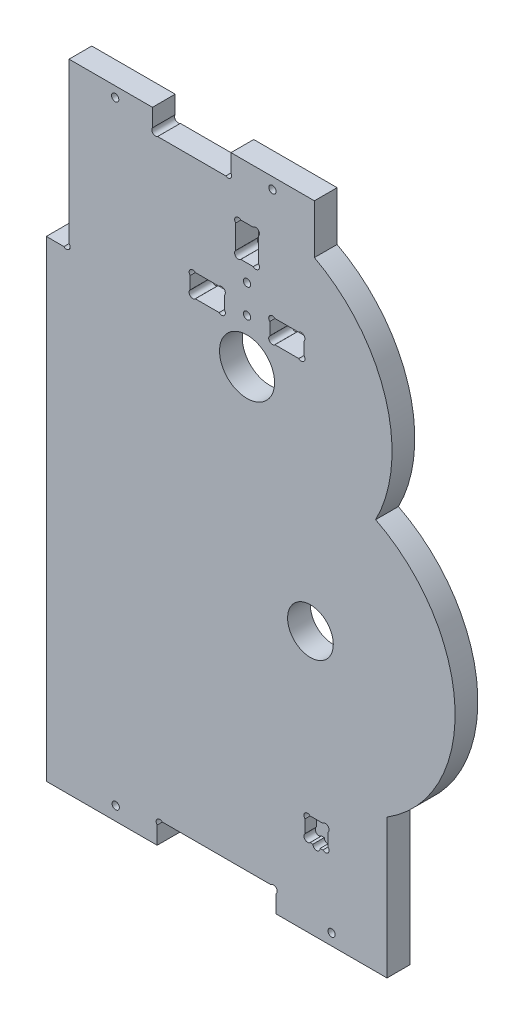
ISO-10303-21;
HEADER;
FILE_DESCRIPTION(('STEP AP214'),'2;1');
FILE_NAME('part.step','',(''),(''),'','','');
FILE_SCHEMA(('AUTOMOTIVE_DESIGN { 1 0 10303 214 1 1 1 1 }'));
ENDSEC;
DATA;
#1=APPLICATION_CONTEXT('core data for automotive mechanical design processes');
#2=APPLICATION_PROTOCOL_DEFINITION('international standard','automotive_design',2000,#1);
#3=PRODUCT_CONTEXT('',#1,'mechanical');
#4=PRODUCT('Part','Part','',(#3));
#5=PRODUCT_RELATED_PRODUCT_CATEGORY('part','',(#4));
#6=PRODUCT_DEFINITION_FORMATION('','',#4);
#7=PRODUCT_DEFINITION_CONTEXT('part definition',#1,'design');
#8=PRODUCT_DEFINITION('design','',#6,#7);
#9=PRODUCT_DEFINITION_SHAPE('','',#8);
#10=(LENGTH_UNIT() NAMED_UNIT(*) SI_UNIT(.MILLI.,.METRE.));
#11=(NAMED_UNIT(*) PLANE_ANGLE_UNIT() SI_UNIT($,.RADIAN.));
#12=(NAMED_UNIT(*) SI_UNIT($,.STERADIAN.) SOLID_ANGLE_UNIT());
#13=UNCERTAINTY_MEASURE_WITH_UNIT(LENGTH_MEASURE(1.E-05),#10,'distance_accuracy_value','');
#14=(GEOMETRIC_REPRESENTATION_CONTEXT(3) GLOBAL_UNCERTAINTY_ASSIGNED_CONTEXT((#13)) GLOBAL_UNIT_ASSIGNED_CONTEXT((#10,
#11,#12)) REPRESENTATION_CONTEXT('',''));
#15=CARTESIAN_POINT('',(0.,0.,0.));
#16=DIRECTION('',(0.,0.,1.));
#17=DIRECTION('',(1.,0.,0.));
#18=AXIS2_PLACEMENT_3D('',#15,#16,#17);
#19=CARTESIAN_POINT('',(-0.0815170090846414,-180.247142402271,10.));
#20=DIRECTION('',(0.,0.,-1.));
#21=DIRECTION('',(-1.,0.,0.));
#22=AXIS2_PLACEMENT_3D('',#19,#20,#21);
#23=CYLINDRICAL_SURFACE('',#22,1.6000000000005);
#24=DIRECTION('',(0.,0.,-1.));
#25=VECTOR('',#24,1.);
#26=CARTESIAN_POINT('',(-1.21288785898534,-181.378513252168,10.));
#27=LINE('',#26,#25);
#28=CARTESIAN_POINT('',(-1.21288785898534,-181.378513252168,10.));
#29=VERTEX_POINT('',#28);
#30=CARTESIAN_POINT('',(-1.21288785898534,-181.378513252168,5.));
#31=VERTEX_POINT('',#30);
#32=EDGE_CURVE('E398',#29,#31,#27,.T.);
#33=ORIENTED_EDGE('',*,*,#32,.T.);
#34=CARTESIAN_POINT('',(-0.0815170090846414,-180.247142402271,5.));
#35=DIRECTION('',(0.,0.,-1.));
#36=DIRECTION('',(-1.,0.,0.));
#37=AXIS2_PLACEMENT_3D('',#34,#35,#36);
#38=CIRCLE('',#37,1.6000000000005);
#39=CARTESIAN_POINT('',(1.04985384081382,-179.115771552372,5.));
#40=VERTEX_POINT('',#39);
#41=EDGE_CURVE('E387',#31,#40,#38,.T.);
#42=ORIENTED_EDGE('',*,*,#41,.T.);
#43=DIRECTION('',(0.,0.,-1.));
#44=VECTOR('',#43,1.);
#45=CARTESIAN_POINT('',(1.04985384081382,-179.115771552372,10.));
#46=LINE('',#45,#44);
#47=CARTESIAN_POINT('',(1.04985384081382,-179.115771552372,10.));
#48=VERTEX_POINT('',#47);
#49=EDGE_CURVE('E395',#48,#40,#46,.T.);
#50=ORIENTED_EDGE('',*,*,#49,.F.);
#51=CARTESIAN_POINT('',(-0.0815170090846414,-180.247142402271,10.));
#52=DIRECTION('',(0.,0.,1.));
#53=DIRECTION('',(-1.,0.,0.));
#54=AXIS2_PLACEMENT_3D('',#51,#52,#53);
#55=CIRCLE('',#54,1.6000000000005);
#56=EDGE_CURVE('E810',#48,#29,#55,.T.);
#57=ORIENTED_EDGE('',*,*,#56,.T.);
#58=EDGE_LOOP('',(#33,#42,#50,#57));
#59=FACE_BOUND('',#58,.T.);
#60=ADVANCED_FACE('F35',(#59),#23,.F.);
#61=CARTESIAN_POINT('',(-1.21288785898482,-187.003029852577,10.));
#62=DIRECTION('',(1.,0.,0.));
#63=DIRECTION('',(0.,1.,0.));
#64=AXIS2_PLACEMENT_3D('',#61,#62,#63);
#65=PLANE('',#64);
#66=DIRECTION('',(0.,0.,-1.));
#67=VECTOR('',#66,1.);
#68=CARTESIAN_POINT('',(-1.21288785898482,-187.003029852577,10.));
#69=LINE('',#68,#67);
#70=CARTESIAN_POINT('',(-1.21288785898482,-187.003029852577,10.));
#71=VERTEX_POINT('',#70);
#72=CARTESIAN_POINT('',(-1.21288785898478,-187.003029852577,5.));
#73=VERTEX_POINT('',#72);
#74=EDGE_CURVE('E430',#71,#73,#69,.T.);
#75=ORIENTED_EDGE('',*,*,#74,.T.);
#76=DIRECTION('',(0.,1.,0.));
#77=VECTOR('',#76,1.);
#78=CARTESIAN_POINT('',(-1.21288785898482,-187.003029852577,5.));
#79=LINE('',#78,#77);
#80=EDGE_CURVE('E400',#73,#31,#79,.T.);
#81=ORIENTED_EDGE('',*,*,#80,.T.);
#82=ORIENTED_EDGE('',*,*,#32,.F.);
#83=DIRECTION('',(0.,-1.,0.));
#84=VECTOR('',#83,1.);
#85=CARTESIAN_POINT('',(-1.21288785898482,-187.003029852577,10.));
#86=LINE('',#85,#84);
#87=EDGE_CURVE('E812',#29,#71,#86,.T.);
#88=ORIENTED_EDGE('',*,*,#87,.T.);
#89=EDGE_LOOP('',(#75,#81,#82,#88));
#90=FACE_BOUND('',#89,.T.);
#91=ADVANCED_FACE('F836',(#90),#65,.T.);
#92=CARTESIAN_POINT('',(-0.0815170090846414,-188.134400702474,10.));
#93=DIRECTION('',(0.,0.,-1.));
#94=DIRECTION('',(-1.,0.,0.));
#95=AXIS2_PLACEMENT_3D('',#92,#93,#94);
#96=CYLINDRICAL_SURFACE('',#95,1.60000000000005);
#97=DIRECTION('',(0.,0.,-1.));
#98=VECTOR('',#97,1.);
#99=CARTESIAN_POINT('',(1.04985384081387,-189.265771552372,10.));
#100=LINE('',#99,#98);
#101=CARTESIAN_POINT('',(1.04985384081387,-189.265771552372,10.));
#102=VERTEX_POINT('',#101);
#103=CARTESIAN_POINT('',(1.04985384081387,-189.265771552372,5.));
#104=VERTEX_POINT('',#103);
#105=EDGE_CURVE('E427',#102,#104,#100,.T.);
#106=ORIENTED_EDGE('',*,*,#105,.T.);
#107=CARTESIAN_POINT('',(-0.0815170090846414,-188.134400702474,5.));
#108=DIRECTION('',(0.,0.,-1.));
#109=DIRECTION('',(-1.,0.,0.));
#110=AXIS2_PLACEMENT_3D('',#107,#108,#109);
#111=CIRCLE('',#110,1.60000000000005);
#112=EDGE_CURVE('E839',#104,#73,#111,.T.);
#113=ORIENTED_EDGE('',*,*,#112,.T.);
#114=ORIENTED_EDGE('',*,*,#74,.F.);
#115=CARTESIAN_POINT('',(-0.0815170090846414,-188.134400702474,10.));
#116=DIRECTION('',(0.,0.,1.));
#117=DIRECTION('',(1.,0.,0.));
#118=AXIS2_PLACEMENT_3D('',#115,#116,#117);
#119=CIRCLE('',#118,1.60000000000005);
#120=EDGE_CURVE('E814',#71,#102,#119,.T.);
#121=ORIENTED_EDGE('',*,*,#120,.T.);
#122=EDGE_LOOP('',(#106,#113,#114,#121));
#123=FACE_BOUND('',#122,.T.);
#124=ADVANCED_FACE('F939',(#123),#96,.F.);
#125=CARTESIAN_POINT('',(1.04985384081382,-189.265771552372,10.));
#126=DIRECTION('',(0.,1.,0.));
#127=DIRECTION('',(0.,0.,1.));
#128=AXIS2_PLACEMENT_3D('',#125,#126,#127);
#129=PLANE('',#128);
#130=DIRECTION('',(0.,0.,-1.));
#131=VECTOR('',#130,1.);
#132=CARTESIAN_POINT('',(2.26211214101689,-189.265771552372,10.));
#133=LINE('',#132,#131);
#134=CARTESIAN_POINT('',(2.26211214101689,-189.265771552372,10.));
#135=VERTEX_POINT('',#134);
#136=CARTESIAN_POINT('',(2.26211214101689,-189.265771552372,5.));
#137=VERTEX_POINT('',#136);
#138=EDGE_CURVE('E424',#135,#137,#133,.T.);
#139=ORIENTED_EDGE('',*,*,#138,.T.);
#140=DIRECTION('',(-1.,0.,0.));
#141=VECTOR('',#140,1.);
#142=CARTESIAN_POINT('',(1.04985384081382,-189.265771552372,5.));
#143=LINE('',#142,#141);
#144=EDGE_CURVE('E841',#137,#104,#143,.T.);
#145=ORIENTED_EDGE('',*,*,#144,.T.);
#146=ORIENTED_EDGE('',*,*,#105,.F.);
#147=DIRECTION('',(1.,0.,0.));
#148=VECTOR('',#147,1.);
#149=CARTESIAN_POINT('',(1.04985384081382,-189.265771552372,10.));
#150=LINE('',#149,#148);
#151=EDGE_CURVE('E816',#102,#135,#150,.T.);
#152=ORIENTED_EDGE('',*,*,#151,.T.);
#153=EDGE_LOOP('',(#139,#145,#146,#152));
#154=FACE_BOUND('',#153,.T.);
#155=ADVANCED_FACE('F1046',(#154),#129,.T.);
#156=CARTESIAN_POINT('',(3.86211214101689,-189.265771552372,10.));
#157=DIRECTION('',(0.,0.,-1.));
#158=DIRECTION('',(-1.,0.,0.));
#159=AXIS2_PLACEMENT_3D('',#156,#157,#158);
#160=CYLINDRICAL_SURFACE('',#159,1.6);
#161=DIRECTION('',(0.,0.,-1.));
#162=VECTOR('',#161,1.);
#163=CARTESIAN_POINT('',(5.46211214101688,-189.265771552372,10.));
#164=LINE('',#163,#162);
#165=CARTESIAN_POINT('',(5.46211214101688,-189.265771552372,10.));
#166=VERTEX_POINT('',#165);
#167=CARTESIAN_POINT('',(5.46211214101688,-189.265771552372,5.));
#168=VERTEX_POINT('',#167);
#169=EDGE_CURVE('E421',#166,#168,#164,.T.);
#170=ORIENTED_EDGE('',*,*,#169,.T.);
#171=CARTESIAN_POINT('',(3.86211214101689,-189.265771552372,5.));
#172=DIRECTION('',(0.,0.,-1.));
#173=DIRECTION('',(-1.,0.,0.));
#174=AXIS2_PLACEMENT_3D('',#171,#172,#173);
#175=CIRCLE('',#174,1.6);
#176=EDGE_CURVE('E1688',#168,#137,#175,.T.);
#177=ORIENTED_EDGE('',*,*,#176,.T.);
#178=ORIENTED_EDGE('',*,*,#138,.F.);
#179=CARTESIAN_POINT('',(3.86211214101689,-189.265771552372,10.));
#180=DIRECTION('',(0.,0.,1.));
#181=DIRECTION('',(1.,0.,0.));
#182=AXIS2_PLACEMENT_3D('',#179,#180,#181);
#183=CIRCLE('',#182,1.6);
#184=EDGE_CURVE('E818',#135,#166,#183,.T.);
#185=ORIENTED_EDGE('',*,*,#184,.T.);
#186=EDGE_LOOP('',(#170,#177,#178,#185));
#187=FACE_BOUND('',#186,.T.);
#188=ADVANCED_FACE('F1038',(#187),#160,.F.);
#189=CARTESIAN_POINT('',(5.46211214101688,-189.265771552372,10.));
#190=DIRECTION('',(0.,1.,0.));
#191=DIRECTION('',(0.,0.,1.));
#192=AXIS2_PLACEMENT_3D('',#189,#190,#191);
#193=PLANE('',#192);
#194=DIRECTION('',(0.,0.,-1.));
#195=VECTOR('',#194,1.);
#196=CARTESIAN_POINT('',(6.67437044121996,-189.265771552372,10.));
#197=LINE('',#196,#195);
#198=CARTESIAN_POINT('',(6.67437044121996,-189.265771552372,10.));
#199=VERTEX_POINT('',#198);
#200=CARTESIAN_POINT('',(6.67437044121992,-189.265771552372,5.));
#201=VERTEX_POINT('',#200);
#202=EDGE_CURVE('E418',#199,#201,#197,.T.);
#203=ORIENTED_EDGE('',*,*,#202,.T.);
#204=DIRECTION('',(-1.,0.,0.));
#205=VECTOR('',#204,1.);
#206=CARTESIAN_POINT('',(5.46211214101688,-189.265771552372,5.));
#207=LINE('',#206,#205);
#208=EDGE_CURVE('E1686',#201,#168,#207,.T.);
#209=ORIENTED_EDGE('',*,*,#208,.T.);
#210=ORIENTED_EDGE('',*,*,#169,.F.);
#211=DIRECTION('',(1.,0.,0.));
#212=VECTOR('',#211,1.);
#213=CARTESIAN_POINT('',(5.46211214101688,-189.265771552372,10.));
#214=LINE('',#213,#212);
#215=EDGE_CURVE('E820',#166,#199,#214,.T.);
#216=ORIENTED_EDGE('',*,*,#215,.T.);
#217=EDGE_LOOP('',(#203,#209,#210,#216));
#218=FACE_BOUND('',#217,.T.);
#219=ADVANCED_FACE('F1030',(#218),#193,.T.);
#220=CARTESIAN_POINT('',(7.80574129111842,-188.134400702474,10.));
#221=DIRECTION('',(0.,0.,-1.));
#222=DIRECTION('',(-1.,0.,0.));
#223=AXIS2_PLACEMENT_3D('',#220,#221,#222);
#224=CYLINDRICAL_SURFACE('',#223,1.60000000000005);
#225=DIRECTION('',(0.,0.,-1.));
#226=VECTOR('',#225,1.);
#227=CARTESIAN_POINT('',(8.93711214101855,-187.003029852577,10.));
#228=LINE('',#227,#226);
#229=CARTESIAN_POINT('',(8.93711214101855,-187.003029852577,10.));
#230=VERTEX_POINT('',#229);
#231=CARTESIAN_POINT('',(8.93711214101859,-187.003029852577,5.));
#232=VERTEX_POINT('',#231);
#233=EDGE_CURVE('E415',#230,#232,#228,.T.);
#234=ORIENTED_EDGE('',*,*,#233,.T.);
#235=CARTESIAN_POINT('',(7.80574129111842,-188.134400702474,5.));
#236=DIRECTION('',(0.,0.,-1.));
#237=DIRECTION('',(-1.,0.,0.));
#238=AXIS2_PLACEMENT_3D('',#235,#236,#237);
#239=CIRCLE('',#238,1.60000000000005);
#240=EDGE_CURVE('E1689',#232,#201,#239,.T.);
#241=ORIENTED_EDGE('',*,*,#240,.T.);
#242=ORIENTED_EDGE('',*,*,#202,.F.);
#243=CARTESIAN_POINT('',(7.80574129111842,-188.134400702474,10.));
#244=DIRECTION('',(0.,0.,1.));
#245=DIRECTION('',(-1.,0.,0.));
#246=AXIS2_PLACEMENT_3D('',#243,#244,#245);
#247=CIRCLE('',#246,1.60000000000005);
#248=EDGE_CURVE('E822',#199,#230,#247,.T.);
#249=ORIENTED_EDGE('',*,*,#248,.T.);
#250=EDGE_LOOP('',(#234,#241,#242,#249));
#251=FACE_BOUND('',#250,.T.);
#252=ADVANCED_FACE('F1022',(#251),#224,.F.);
#253=CARTESIAN_POINT('',(8.93711214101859,-187.003029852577,10.));
#254=DIRECTION('',(-1.,0.,0.));
#255=DIRECTION('',(0.,-1.,0.));
#256=AXIS2_PLACEMENT_3D('',#253,#254,#255);
#257=PLANE('',#256);
#258=DIRECTION('',(0.,0.,-1.));
#259=VECTOR('',#258,1.);
#260=CARTESIAN_POINT('',(8.93711214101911,-181.378513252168,10.));
#261=LINE('',#260,#259);
#262=CARTESIAN_POINT('',(8.93711214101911,-181.378513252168,10.));
#263=VERTEX_POINT('',#262);
#264=CARTESIAN_POINT('',(8.93711214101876,-181.378513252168,5.));
#265=VERTEX_POINT('',#264);
#266=EDGE_CURVE('E407',#263,#265,#261,.T.);
#267=ORIENTED_EDGE('',*,*,#266,.T.);
#268=DIRECTION('',(0.,-1.,0.));
#269=VECTOR('',#268,1.);
#270=CARTESIAN_POINT('',(8.93711214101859,-187.003029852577,5.));
#271=LINE('',#270,#269);
#272=EDGE_CURVE('E1692',#265,#232,#271,.T.);
#273=ORIENTED_EDGE('',*,*,#272,.T.);
#274=ORIENTED_EDGE('',*,*,#233,.F.);
#275=DIRECTION('',(0.,1.,0.));
#276=VECTOR('',#275,1.);
#277=CARTESIAN_POINT('',(8.93711214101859,-187.003029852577,10.));
#278=LINE('',#277,#276);
#279=EDGE_CURVE('E824',#230,#263,#278,.T.);
#280=ORIENTED_EDGE('',*,*,#279,.T.);
#281=EDGE_LOOP('',(#267,#273,#274,#280));
#282=FACE_BOUND('',#281,.T.);
#283=ADVANCED_FACE('F1015',(#282),#257,.T.);
#284=CARTESIAN_POINT('',(7.80574129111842,-180.247142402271,10.));
#285=DIRECTION('',(0.,0.,-1.));
#286=DIRECTION('',(-1.,0.,0.));
#287=AXIS2_PLACEMENT_3D('',#284,#285,#286);
#288=CYLINDRICAL_SURFACE('',#287,1.6000000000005);
#289=DIRECTION('',(0.,0.,-1.));
#290=VECTOR('',#289,1.);
#291=CARTESIAN_POINT('',(6.6743704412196,-179.115771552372,10.));
#292=LINE('',#291,#290);
#293=CARTESIAN_POINT('',(6.6743704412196,-179.115771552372,10.));
#294=VERTEX_POINT('',#293);
#295=CARTESIAN_POINT('',(6.6743704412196,-179.115771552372,5.));
#296=VERTEX_POINT('',#295);
#297=EDGE_CURVE('E405',#294,#296,#292,.T.);
#298=ORIENTED_EDGE('',*,*,#297,.T.);
#299=CARTESIAN_POINT('',(7.80574129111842,-180.247142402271,5.));
#300=DIRECTION('',(0.,0.,-1.));
#301=DIRECTION('',(-1.,0.,0.));
#302=AXIS2_PLACEMENT_3D('',#299,#300,#301);
#303=CIRCLE('',#302,1.6000000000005);
#304=EDGE_CURVE('E50',#296,#265,#303,.T.);
#305=ORIENTED_EDGE('',*,*,#304,.T.);
#306=ORIENTED_EDGE('',*,*,#266,.F.);
#307=CARTESIAN_POINT('',(7.80574129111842,-180.247142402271,10.));
#308=DIRECTION('',(0.,0.,1.));
#309=DIRECTION('',(1.,0.,0.));
#310=AXIS2_PLACEMENT_3D('',#307,#308,#309);
#311=CIRCLE('',#310,1.6000000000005);
#312=EDGE_CURVE('E409',#263,#294,#311,.T.);
#313=ORIENTED_EDGE('',*,*,#312,.T.);
#314=EDGE_LOOP('',(#298,#305,#306,#313));
#315=FACE_BOUND('',#314,.T.);
#316=ADVANCED_FACE('F829',(#315),#288,.F.);
#317=CARTESIAN_POINT('',(1.04985384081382,-179.115771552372,10.));
#318=DIRECTION('',(0.,-1.,0.));
#319=DIRECTION('',(0.,0.,-1.));
#320=AXIS2_PLACEMENT_3D('',#317,#318,#319);
#321=PLANE('',#320);
#322=ORIENTED_EDGE('',*,*,#49,.T.);
#323=DIRECTION('',(1.,0.,0.));
#324=VECTOR('',#323,1.);
#325=CARTESIAN_POINT('',(1.04985384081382,-179.115771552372,5.));
#326=LINE('',#325,#324);
#327=EDGE_CURVE('E11',#40,#296,#326,.T.);
#328=ORIENTED_EDGE('',*,*,#327,.T.);
#329=ORIENTED_EDGE('',*,*,#297,.F.);
#330=DIRECTION('',(-1.,0.,0.));
#331=VECTOR('',#330,1.);
#332=CARTESIAN_POINT('',(1.04985384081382,-179.115771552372,10.));
#333=LINE('',#332,#331);
#334=EDGE_CURVE('E404',#294,#48,#333,.T.);
#335=ORIENTED_EDGE('',*,*,#334,.T.);
#336=EDGE_LOOP('',(#322,#328,#329,#335));
#337=FACE_BOUND('',#336,.T.);
#338=ADVANCED_FACE('F402',(#337),#321,.T.);
#339=CARTESIAN_POINT('',(1.18882163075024,-108.689780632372,10.));
#340=DIRECTION('',(0.,0.,1.));
#341=DIRECTION('',(1.,0.,0.));
#342=AXIS2_PLACEMENT_3D('',#339,#340,#341);
#343=PLANE('',#342);
#344=CARTESIAN_POINT('',(-15.5254400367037,51.1372901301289,10.));
#345=DIRECTION('',(0.,0.,-1.));
#346=DIRECTION('',(-1.,0.,0.));
#347=AXIS2_PLACEMENT_3D('',#344,#345,#346);
#348=CIRCLE('',#347,1.60000000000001);
#349=CARTESIAN_POINT('',(-17.1254400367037,51.1372901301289,10.));
#350=VERTEX_POINT('',#349);
#351=EDGE_CURVE('E845',#350,#350,#348,.T.);
#352=ORIENTED_EDGE('',*,*,#351,.T.);
#353=EDGE_LOOP('',(#352));
#354=FACE_BOUND('',#353,.T.);
#355=CARTESIAN_POINT('',(10.483182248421,-218.937847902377,10.));
#356=DIRECTION('',(0.,0.,-1.));
#357=DIRECTION('',(-1.,0.,0.));
#358=AXIS2_PLACEMENT_3D('',#355,#356,#357);
#359=CIRCLE('',#358,1.60000000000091);
#360=CARTESIAN_POINT('',(8.88318224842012,-218.937847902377,10.));
#361=VERTEX_POINT('',#360);
#362=EDGE_CURVE('E851',#361,#361,#359,.T.);
#363=ORIENTED_EDGE('',*,*,#362,.T.);
#364=EDGE_LOOP('',(#363));
#365=FACE_BOUND('',#364,.T.);
#366=CARTESIAN_POINT('',(-84.4275217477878,-217.94089488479,10.));
#367=DIRECTION('',(0.,0.,-1.));
#368=DIRECTION('',(-1.,0.,0.));
#369=AXIS2_PLACEMENT_3D('',#366,#367,#368);
#370=CIRCLE('',#369,1.6);
#371=CARTESIAN_POINT('',(-86.0275217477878,-217.94089488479,10.));
#372=VERTEX_POINT('',#371);
#373=EDGE_CURVE('E857',#372,#372,#370,.T.);
#374=ORIENTED_EDGE('',*,*,#373,.T.);
#375=EDGE_LOOP('',(#374));
#376=FACE_BOUND('',#375,.T.);
#377=CARTESIAN_POINT('',(-84.6764257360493,51.5912733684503,10.));
#378=DIRECTION('',(0.,0.,-1.));
#379=DIRECTION('',(-1.,0.,0.));
#380=AXIS2_PLACEMENT_3D('',#377,#378,#379);
#381=CIRCLE('',#380,1.60000000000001);
#382=CARTESIAN_POINT('',(-86.2764257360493,51.5912733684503,10.));
#383=VERTEX_POINT('',#382);
#384=EDGE_CURVE('E863',#383,#383,#381,.T.);
#385=ORIENTED_EDGE('',*,*,#384,.T.);
#386=EDGE_LOOP('',(#385));
#387=FACE_BOUND('',#386,.T.);
#388=CARTESIAN_POINT('',(-26.6956127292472,-2.43784790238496,10.));
#389=DIRECTION('',(0.,0.,1.));
#390=DIRECTION('',(1.,0.,0.));
#391=AXIS2_PLACEMENT_3D('',#388,#389,#390);
#392=CIRCLE('',#391,1.6);
#393=CARTESIAN_POINT('',(-25.0956127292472,-2.43784790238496,10.));
#394=VERTEX_POINT('',#393);
#395=EDGE_CURVE('E687',#394,#394,#392,.T.);
#396=ORIENTED_EDGE('',*,*,#395,.F.);
#397=EDGE_LOOP('',(#396));
#398=FACE_BOUND('',#397,.T.);
#399=CARTESIAN_POINT('',(-26.6956127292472,-21.937847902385,10.));
#400=DIRECTION('',(0.,0.,1.));
#401=DIRECTION('',(1.,0.,0.));
#402=AXIS2_PLACEMENT_3D('',#399,#400,#401);
#403=CIRCLE('',#402,12.1);
#404=CARTESIAN_POINT('',(-14.5956127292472,-21.937847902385,10.));
#405=VERTEX_POINT('',#404);
#406=EDGE_CURVE('E441',#405,#405,#403,.T.);
#407=ORIENTED_EDGE('',*,*,#406,.F.);
#408=EDGE_LOOP('',(#407));
#409=FACE_BOUND('',#408,.T.);
#410=CARTESIAN_POINT('',(1.18882163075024,-108.689780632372,10.));
#411=DIRECTION('',(0.,0.,1.));
#412=DIRECTION('',(1.,0.,0.));
#413=AXIS2_PLACEMENT_3D('',#410,#411,#412);
#414=CIRCLE('',#413,10.05);
#415=CARTESIAN_POINT('',(11.2388216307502,-108.689780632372,10.));
#416=VERTEX_POINT('',#415);
#417=EDGE_CURVE('E435',#416,#416,#414,.T.);
#418=ORIENTED_EDGE('',*,*,#417,.F.);
#419=EDGE_LOOP('',(#418));
#420=FACE_BOUND('',#419,.T.);
#421=ORIENTED_EDGE('',*,*,#87,.F.);
#422=ORIENTED_EDGE('',*,*,#56,.F.);
#423=ORIENTED_EDGE('',*,*,#334,.F.);
#424=ORIENTED_EDGE('',*,*,#312,.F.);
#425=ORIENTED_EDGE('',*,*,#279,.F.);
#426=ORIENTED_EDGE('',*,*,#248,.F.);
#427=ORIENTED_EDGE('',*,*,#215,.F.);
#428=ORIENTED_EDGE('',*,*,#184,.F.);
#429=ORIENTED_EDGE('',*,*,#151,.F.);
#430=ORIENTED_EDGE('',*,*,#120,.F.);
#431=EDGE_LOOP('',(#421,#422,#423,#424,#425,#426,#427,#428,#429,#430));
#432=FACE_BOUND('',#431,.T.);
#433=DIRECTION('',(1.,0.,0.));
#434=VECTOR('',#433,1.);
#435=CARTESIAN_POINT('',(-38.9583544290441,-7.43784790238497,10.));
#436=LINE('',#435,#434);
#437=CARTESIAN_POINT('',(-49.4328710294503,-7.43784790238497,10.));
#438=VERTEX_POINT('',#437);
#439=CARTESIAN_POINT('',(-38.9583544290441,-7.43784790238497,10.));
#440=VERTEX_POINT('',#439);
#441=EDGE_CURVE('E754',#438,#440,#436,.T.);
#442=ORIENTED_EDGE('',*,*,#441,.F.);
#443=CARTESIAN_POINT('',(-50.5642418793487,-6.30647705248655,10.));
#444=DIRECTION('',(0.,0.,1.));
#445=DIRECTION('',(1.,0.,0.));
#446=AXIS2_PLACEMENT_3D('',#443,#444,#445);
#447=CIRCLE('',#446,1.59999999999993);
#448=CARTESIAN_POINT('',(-51.6956127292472,-5.17510620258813,10.));
#449=VERTEX_POINT('',#448);
#450=EDGE_CURVE('E752',#449,#438,#447,.T.);
#451=ORIENTED_EDGE('',*,*,#450,.F.);
#452=DIRECTION('',(0.,-1.,0.));
#453=VECTOR('',#452,1.);
#454=CARTESIAN_POINT('',(-51.6956127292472,-5.17510620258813,10.));
#455=LINE('',#454,#453);
#456=CARTESIAN_POINT('',(-51.6956127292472,0.299410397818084,10.));
#457=VERTEX_POINT('',#456);
#458=EDGE_CURVE('E768',#457,#449,#455,.T.);
#459=ORIENTED_EDGE('',*,*,#458,.F.);
#460=CARTESIAN_POINT('',(-50.5642418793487,1.43078124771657,10.));
#461=DIRECTION('',(0.,0.,1.));
#462=DIRECTION('',(-1.,0.,0.));
#463=AXIS2_PLACEMENT_3D('',#460,#461,#462);
#464=CIRCLE('',#463,1.6);
#465=CARTESIAN_POINT('',(-49.4328710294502,2.56215209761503,10.));
#466=VERTEX_POINT('',#465);
#467=EDGE_CURVE('E765',#466,#457,#464,.T.);
#468=ORIENTED_EDGE('',*,*,#467,.F.);
#469=DIRECTION('',(-1.,0.,0.));
#470=VECTOR('',#469,1.);
#471=CARTESIAN_POINT('',(-38.9583544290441,2.56215209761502,10.));
#472=LINE('',#471,#470);
#473=CARTESIAN_POINT('',(-38.9583544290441,2.56215209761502,10.));
#474=VERTEX_POINT('',#473);
#475=EDGE_CURVE('E763',#474,#466,#472,.T.);
#476=ORIENTED_EDGE('',*,*,#475,.F.);
#477=CARTESIAN_POINT('',(-37.8269835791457,1.43078124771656,10.));
#478=DIRECTION('',(0.,0.,1.));
#479=DIRECTION('',(1.,0.,0.));
#480=AXIS2_PLACEMENT_3D('',#477,#478,#479);
#481=CIRCLE('',#480,1.6);
#482=CARTESIAN_POINT('',(-36.6956127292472,0.299410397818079,10.));
#483=VERTEX_POINT('',#482);
#484=EDGE_CURVE('E761',#483,#474,#481,.T.);
#485=ORIENTED_EDGE('',*,*,#484,.F.);
#486=DIRECTION('',(0.,1.,0.));
#487=VECTOR('',#486,1.);
#488=CARTESIAN_POINT('',(-36.6956127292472,-5.17510620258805,10.));
#489=LINE('',#488,#487);
#490=CARTESIAN_POINT('',(-36.6956127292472,-5.17510620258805,10.));
#491=VERTEX_POINT('',#490);
#492=EDGE_CURVE('E759',#491,#483,#489,.T.);
#493=ORIENTED_EDGE('',*,*,#492,.F.);
#494=CARTESIAN_POINT('',(-37.8269835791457,-6.3064770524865,10.));
#495=DIRECTION('',(0.,0.,1.));
#496=DIRECTION('',(-1.,0.,0.));
#497=AXIS2_PLACEMENT_3D('',#494,#495,#496);
#498=CIRCLE('',#497,1.59999999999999);
#499=EDGE_CURVE('E757',#440,#491,#498,.T.);
#500=ORIENTED_EDGE('',*,*,#499,.F.);
#501=EDGE_LOOP('',(#442,#451,#459,#468,#476,#485,#493,#500));
#502=FACE_BOUND('',#501,.T.);
#503=DIRECTION('',(1.,0.,0.));
#504=VECTOR('',#503,1.);
#505=CARTESIAN_POINT('',(-14.4328710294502,-7.43784790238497,10.));
#506=LINE('',#505,#504);
#507=CARTESIAN_POINT('',(-14.4328710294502,-7.43784790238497,10.));
#508=VERTEX_POINT('',#507);
#509=CARTESIAN_POINT('',(-3.95835442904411,-7.43784790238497,10.));
#510=VERTEX_POINT('',#509);
#511=EDGE_CURVE('E695',#508,#510,#506,.T.);
#512=ORIENTED_EDGE('',*,*,#511,.F.);
#513=CARTESIAN_POINT('',(-15.5642418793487,-6.3064770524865,10.));
#514=DIRECTION('',(0.,0.,1.));
#515=DIRECTION('',(1.,0.,0.));
#516=AXIS2_PLACEMENT_3D('',#513,#514,#515);
#517=CIRCLE('',#516,1.59999999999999);
#518=CARTESIAN_POINT('',(-16.6956127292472,-5.17510620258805,10.));
#519=VERTEX_POINT('',#518);
#520=EDGE_CURVE('E693',#519,#508,#517,.T.);
#521=ORIENTED_EDGE('',*,*,#520,.F.);
#522=DIRECTION('',(0.,-1.,0.));
#523=VECTOR('',#522,1.);
#524=CARTESIAN_POINT('',(-16.6956127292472,-5.17510620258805,10.));
#525=LINE('',#524,#523);
#526=CARTESIAN_POINT('',(-16.6956127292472,0.29941039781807,10.));
#527=VERTEX_POINT('',#526);
#528=EDGE_CURVE('E709',#527,#519,#525,.T.);
#529=ORIENTED_EDGE('',*,*,#528,.F.);
#530=CARTESIAN_POINT('',(-15.5642418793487,1.43078124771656,10.));
#531=DIRECTION('',(0.,0.,1.));
#532=DIRECTION('',(-1.,0.,0.));
#533=AXIS2_PLACEMENT_3D('',#530,#531,#532);
#534=CIRCLE('',#533,1.6);
#535=CARTESIAN_POINT('',(-14.4328710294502,2.56215209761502,10.));
#536=VERTEX_POINT('',#535);
#537=EDGE_CURVE('E706',#536,#527,#534,.T.);
#538=ORIENTED_EDGE('',*,*,#537,.F.);
#539=DIRECTION('',(-1.,0.,0.));
#540=VECTOR('',#539,1.);
#541=CARTESIAN_POINT('',(-14.4328710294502,2.56215209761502,10.));
#542=LINE('',#541,#540);
#543=CARTESIAN_POINT('',(-3.95835442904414,2.56215209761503,10.));
#544=VERTEX_POINT('',#543);
#545=EDGE_CURVE('E704',#544,#536,#542,.T.);
#546=ORIENTED_EDGE('',*,*,#545,.F.);
#547=CARTESIAN_POINT('',(-2.82698357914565,1.43078124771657,10.));
#548=DIRECTION('',(0.,0.,1.));
#549=DIRECTION('',(1.,0.,0.));
#550=AXIS2_PLACEMENT_3D('',#547,#548,#549);
#551=CIRCLE('',#550,1.6);
#552=CARTESIAN_POINT('',(-1.69561272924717,0.299410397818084,10.));
#553=VERTEX_POINT('',#552);
#554=EDGE_CURVE('E702',#553,#544,#551,.T.);
#555=ORIENTED_EDGE('',*,*,#554,.F.);
#556=DIRECTION('',(0.,1.,0.));
#557=VECTOR('',#556,1.);
#558=CARTESIAN_POINT('',(-1.69561272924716,-5.17510620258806,10.));
#559=LINE('',#558,#557);
#560=CARTESIAN_POINT('',(-1.69561272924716,-5.17510620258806,10.));
#561=VERTEX_POINT('',#560);
#562=EDGE_CURVE('E700',#561,#553,#559,.T.);
#563=ORIENTED_EDGE('',*,*,#562,.F.);
#564=CARTESIAN_POINT('',(-2.82698357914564,-6.30647705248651,10.));
#565=DIRECTION('',(0.,0.,1.));
#566=DIRECTION('',(-1.,0.,0.));
#567=AXIS2_PLACEMENT_3D('',#564,#565,#566);
#568=CIRCLE('',#567,1.59999999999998);
#569=EDGE_CURVE('E698',#510,#561,#568,.T.);
#570=ORIENTED_EDGE('',*,*,#569,.F.);
#571=EDGE_LOOP('',(#512,#521,#529,#538,#546,#555,#563,#570));
#572=FACE_BOUND('',#571,.T.);
#573=CARTESIAN_POINT('',(-26.6956127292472,10.062152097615,10.));
#574=DIRECTION('',(0.,0.,1.));
#575=DIRECTION('',(1.,0.,0.));
#576=AXIS2_PLACEMENT_3D('',#573,#574,#575);
#577=CIRCLE('',#576,1.6);
#578=CARTESIAN_POINT('',(-25.0956127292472,10.062152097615,10.));
#579=VERTEX_POINT('',#578);
#580=EDGE_CURVE('E681',#579,#579,#577,.T.);
#581=ORIENTED_EDGE('',*,*,#580,.F.);
#582=EDGE_LOOP('',(#581));
#583=FACE_BOUND('',#582,.T.);
#584=DIRECTION('',(1.,0.,0.));
#585=VECTOR('',#584,1.);
#586=CARTESIAN_POINT('',(-29.4328710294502,17.562152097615,10.));
#587=LINE('',#586,#585);
#588=CARTESIAN_POINT('',(-29.4328710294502,17.562152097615,10.));
#589=VERTEX_POINT('',#588);
#590=CARTESIAN_POINT('',(-23.9583544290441,17.562152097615,10.));
#591=VERTEX_POINT('',#590);
#592=EDGE_CURVE('E624',#589,#591,#587,.T.);
#593=ORIENTED_EDGE('',*,*,#592,.F.);
#594=CARTESIAN_POINT('',(-30.5642418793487,18.6935229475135,10.));
#595=DIRECTION('',(0.,0.,1.));
#596=DIRECTION('',(1.,0.,0.));
#597=AXIS2_PLACEMENT_3D('',#594,#595,#596);
#598=CIRCLE('',#597,1.59999999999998);
#599=CARTESIAN_POINT('',(-31.6956127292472,19.8248937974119,10.));
#600=VERTEX_POINT('',#599);
#601=EDGE_CURVE('E622',#600,#589,#598,.T.);
#602=ORIENTED_EDGE('',*,*,#601,.F.);
#603=DIRECTION('',(0.,-1.,0.));
#604=VECTOR('',#603,1.);
#605=CARTESIAN_POINT('',(-31.6956127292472,30.2994103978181,10.));
#606=LINE('',#605,#604);
#607=CARTESIAN_POINT('',(-31.6956127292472,30.2994103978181,10.));
#608=VERTEX_POINT('',#607);
#609=EDGE_CURVE('E638',#608,#600,#606,.T.);
#610=ORIENTED_EDGE('',*,*,#609,.F.);
#611=CARTESIAN_POINT('',(-30.5642418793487,31.4307812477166,10.));
#612=DIRECTION('',(0.,0.,1.));
#613=DIRECTION('',(-1.,0.,0.));
#614=AXIS2_PLACEMENT_3D('',#611,#612,#613);
#615=CIRCLE('',#614,1.6);
#616=CARTESIAN_POINT('',(-29.4328710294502,32.562152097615,10.));
#617=VERTEX_POINT('',#616);
#618=EDGE_CURVE('E635',#617,#608,#615,.T.);
#619=ORIENTED_EDGE('',*,*,#618,.F.);
#620=DIRECTION('',(-1.,0.,0.));
#621=VECTOR('',#620,1.);
#622=CARTESIAN_POINT('',(-23.9583544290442,32.5621520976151,10.));
#623=LINE('',#622,#621);
#624=CARTESIAN_POINT('',(-23.9583544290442,32.5621520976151,10.));
#625=VERTEX_POINT('',#624);
#626=EDGE_CURVE('E633',#625,#617,#623,.T.);
#627=ORIENTED_EDGE('',*,*,#626,.F.);
#628=CARTESIAN_POINT('',(-22.8269835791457,31.4307812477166,10.));
#629=DIRECTION('',(0.,0.,1.));
#630=DIRECTION('',(1.,0.,0.));
#631=AXIS2_PLACEMENT_3D('',#628,#629,#630);
#632=CIRCLE('',#631,1.6);
#633=CARTESIAN_POINT('',(-21.6956127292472,30.2994103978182,10.));
#634=VERTEX_POINT('',#633);
#635=EDGE_CURVE('E631',#634,#625,#632,.T.);
#636=ORIENTED_EDGE('',*,*,#635,.F.);
#637=DIRECTION('',(0.,1.,0.));
#638=VECTOR('',#637,1.);
#639=CARTESIAN_POINT('',(-21.6956127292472,19.8248937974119,10.));
#640=LINE('',#639,#638);
#641=CARTESIAN_POINT('',(-21.6956127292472,19.8248937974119,10.));
#642=VERTEX_POINT('',#641);
#643=EDGE_CURVE('E629',#642,#634,#640,.T.);
#644=ORIENTED_EDGE('',*,*,#643,.F.);
#645=CARTESIAN_POINT('',(-22.8269835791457,18.6935229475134,10.));
#646=DIRECTION('',(0.,0.,1.));
#647=DIRECTION('',(-1.,0.,0.));
#648=AXIS2_PLACEMENT_3D('',#645,#646,#647);
#649=CIRCLE('',#648,1.6);
#650=EDGE_CURVE('E627',#591,#642,#649,.T.);
#651=ORIENTED_EDGE('',*,*,#650,.F.);
#652=EDGE_LOOP('',(#593,#602,#610,#619,#627,#636,#644,#651));
#653=FACE_BOUND('',#652,.T.);
#654=CARTESIAN_POINT('',(-106.092549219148,-15.3064770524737,10.));
#655=DIRECTION('',(0.,0.,1.));
#656=DIRECTION('',(1.,0.,0.));
#657=AXIS2_PLACEMENT_3D('',#654,#655,#656);
#658=CIRCLE('',#657,1.6);
#659=CARTESIAN_POINT('',(-104.96117836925,-14.1751062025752,10.));
#660=VERTEX_POINT('',#659);
#661=CARTESIAN_POINT('',(-107.223920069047,-16.4378479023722,10.));
#662=VERTEX_POINT('',#661);
#663=EDGE_CURVE('E57',#660,#662,#658,.F.);
#664=ORIENTED_EDGE('',*,*,#663,.T.);
#665=DIRECTION('',(-1.,0.,0.));
#666=VECTOR('',#665,1.);
#667=CARTESIAN_POINT('',(1.18882163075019,-16.4378479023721,10.));
#668=LINE('',#667,#666);
#669=CARTESIAN_POINT('',(-114.96117836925,-16.4378479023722,10.));
#670=VERTEX_POINT('',#669);
#671=EDGE_CURVE('E888',#662,#670,#668,.T.);
#672=ORIENTED_EDGE('',*,*,#671,.T.);
#673=DIRECTION('',(0.,-1.,0.));
#674=VECTOR('',#673,1.);
#675=CARTESIAN_POINT('',(-114.96117836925,56.0621520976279,10.));
#676=LINE('',#675,#674);
#677=CARTESIAN_POINT('',(-114.96117836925,-223.937847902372,10.));
#678=VERTEX_POINT('',#677);
#679=EDGE_CURVE('E459',#670,#678,#676,.T.);
#680=ORIENTED_EDGE('',*,*,#679,.T.);
#681=DIRECTION('',(1.,0.,0.));
#682=VECTOR('',#681,1.);
#683=CARTESIAN_POINT('',(24.8581822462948,-223.937847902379,10.));
#684=LINE('',#683,#682);
#685=CARTESIAN_POINT('',(-66.2111783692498,-223.937847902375,10.));
#686=VERTEX_POINT('',#685);
#687=EDGE_CURVE('E462',#678,#686,#684,.T.);
#688=ORIENTED_EDGE('',*,*,#687,.T.);
#689=DIRECTION('',(0.,-1.,0.));
#690=VECTOR('',#689,1.);
#691=CARTESIAN_POINT('',(-66.2111783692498,-223.937847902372,10.));
#692=LINE('',#691,#690);
#693=CARTESIAN_POINT('',(-66.2111783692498,-216.200589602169,10.));
#694=VERTEX_POINT('',#693);
#695=EDGE_CURVE('E544',#694,#686,#692,.T.);
#696=ORIENTED_EDGE('',*,*,#695,.F.);
#697=CARTESIAN_POINT('',(-65.0798075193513,-215.069218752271,10.));
#698=DIRECTION('',(0.,0.,1.));
#699=DIRECTION('',(1.,0.,0.));
#700=AXIS2_PLACEMENT_3D('',#697,#698,#699);
#701=CIRCLE('',#700,1.60000000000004);
#702=CARTESIAN_POINT('',(-63.9484366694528,-213.937847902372,10.));
#703=VERTEX_POINT('',#702);
#704=EDGE_CURVE('E548',#703,#694,#701,.T.);
#705=ORIENTED_EDGE('',*,*,#704,.F.);
#706=DIRECTION('',(-1.,0.,0.));
#707=VECTOR('',#706,1.);
#708=CARTESIAN_POINT('',(-16.1545594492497,-213.937847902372,10.));
#709=LINE('',#708,#707);
#710=CARTESIAN_POINT('',(-16.1545594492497,-213.937847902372,10.));
#711=VERTEX_POINT('',#710);
#712=EDGE_CURVE('E567',#711,#703,#709,.T.);
#713=ORIENTED_EDGE('',*,*,#712,.F.);
#714=CARTESIAN_POINT('',(-15.0231885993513,-215.069218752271,10.));
#715=DIRECTION('',(0.,0.,1.));
#716=DIRECTION('',(1.,0.,0.));
#717=AXIS2_PLACEMENT_3D('',#714,#715,#716);
#718=CIRCLE('',#717,1.6);
#719=CARTESIAN_POINT('',(-13.8918177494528,-216.200589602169,10.));
#720=VERTEX_POINT('',#719);
#721=EDGE_CURVE('E564',#720,#711,#718,.T.);
#722=ORIENTED_EDGE('',*,*,#721,.F.);
#723=DIRECTION('',(0.,1.,0.));
#724=VECTOR('',#723,1.);
#725=CARTESIAN_POINT('',(-13.8918177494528,-223.937847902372,10.));
#726=LINE('',#725,#724);
#727=CARTESIAN_POINT('',(-13.8918177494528,-223.937847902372,10.));
#728=VERTEX_POINT('',#727);
#729=EDGE_CURVE('E561',#728,#720,#726,.T.);
#730=ORIENTED_EDGE('',*,*,#729,.F.);
#731=CARTESIAN_POINT('',(34.8581822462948,-223.937847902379,10.));
#732=VERTEX_POINT('',#731);
#733=EDGE_CURVE('E461',#728,#732,#684,.T.);
#734=ORIENTED_EDGE('',*,*,#733,.T.);
#735=DIRECTION('',(0.,1.,0.));
#736=VECTOR('',#735,1.);
#737=CARTESIAN_POINT('',(34.8581822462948,-223.937847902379,10.));
#738=LINE('',#737,#736);
#739=CARTESIAN_POINT('',(34.8581822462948,-162.655636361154,10.));
#740=VERTEX_POINT('',#739);
#741=EDGE_CURVE('E465',#732,#740,#738,.T.);
#742=ORIENTED_EDGE('',*,*,#741,.T.);
#743=CARTESIAN_POINT('',(1.18882163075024,-108.689780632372,10.));
#744=DIRECTION('',(0.,0.,1.));
#745=DIRECTION('',(1.,0.,0.));
#746=AXIS2_PLACEMENT_3D('',#743,#744,#745);
#747=CIRCLE('',#746,63.607699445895);
#748=CARTESIAN_POINT('',(29.8581822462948,-51.9094390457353,10.));
#749=VERTEX_POINT('',#748);
#750=EDGE_CURVE('E447',#740,#749,#747,.T.);
#751=ORIENTED_EDGE('',*,*,#750,.T.);
#752=CARTESIAN_POINT('',(-27.1851263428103,-22.3373245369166,10.));
#753=DIRECTION('',(0.,0.,1.));
#754=DIRECTION('',(1.,0.,0.));
#755=AXIS2_PLACEMENT_3D('',#752,#753,#754);
#756=CIRCLE('',#755,64.2530077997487);
#757=CARTESIAN_POINT('',(2.92254891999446,34.4251357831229,10.));
#758=VERTEX_POINT('',#757);
#759=EDGE_CURVE('E450',#749,#758,#756,.T.);
#760=ORIENTED_EDGE('',*,*,#759,.T.);
#761=DIRECTION('',(0.,1.,0.));
#762=VECTOR('',#761,1.);
#763=CARTESIAN_POINT('',(2.92254891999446,56.0621520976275,10.));
#764=LINE('',#763,#762);
#765=CARTESIAN_POINT('',(2.92254891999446,56.0621520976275,10.));
#766=VERTEX_POINT('',#765);
#767=EDGE_CURVE('E453',#758,#766,#764,.T.);
#768=ORIENTED_EDGE('',*,*,#767,.T.);
#769=DIRECTION('',(-1.,0.,0.));
#770=VECTOR('',#769,1.);
#771=CARTESIAN_POINT('',(2.92254891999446,56.0621520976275,10.));
#772=LINE('',#771,#770);
#773=CARTESIAN_POINT('',(-33.7556172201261,56.0621520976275,10.));
#774=VERTEX_POINT('',#773);
#775=EDGE_CURVE('E456',#766,#774,#772,.T.);
#776=ORIENTED_EDGE('',*,*,#775,.T.);
#777=DIRECTION('',(0.,1.,0.));
#778=VECTOR('',#777,1.);
#779=CARTESIAN_POINT('',(-33.7556172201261,56.0621520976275,10.));
#780=LINE('',#779,#778);
#781=CARTESIAN_POINT('',(-33.7556172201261,48.2513097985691,10.));
#782=VERTEX_POINT('',#781);
#783=EDGE_CURVE('E526',#782,#774,#780,.T.);
#784=ORIENTED_EDGE('',*,*,#783,.F.);
#785=CARTESIAN_POINT('',(-35.0859379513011,47.3623515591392,10.));
#786=DIRECTION('',(0.,0.,1.));
#787=DIRECTION('',(1.,0.,0.));
#788=AXIS2_PLACEMENT_3D('',#785,#786,#787);
#789=CIRCLE('',#788,1.59999999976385);
#790=CARTESIAN_POINT('',(-36.0183977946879,46.0621520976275,10.));
#791=VERTEX_POINT('',#790);
#792=EDGE_CURVE('E586',#791,#782,#789,.T.);
#793=ORIENTED_EDGE('',*,*,#792,.F.);
#794=DIRECTION('',(1.,0.,0.));
#795=VECTOR('',#794,1.);
#796=CARTESIAN_POINT('',(-36.0183977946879,46.0621520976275,10.));
#797=LINE('',#796,#795);
#798=CARTESIAN_POINT('',(-66.018397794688,46.0621520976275,10.));
#799=VERTEX_POINT('',#798);
#800=EDGE_CURVE('E605',#799,#791,#797,.T.);
#801=ORIENTED_EDGE('',*,*,#800,.F.);
#802=CARTESIAN_POINT('',(-66.9508576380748,47.3623515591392,10.));
#803=DIRECTION('',(0.,0.,1.));
#804=DIRECTION('',(-1.,0.,0.));
#805=AXIS2_PLACEMENT_3D('',#802,#803,#804);
#806=CIRCLE('',#805,1.59999999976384);
#807=CARTESIAN_POINT('',(-68.2811783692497,48.2513097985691,10.));
#808=VERTEX_POINT('',#807);
#809=EDGE_CURVE('E602',#808,#799,#806,.T.);
#810=ORIENTED_EDGE('',*,*,#809,.F.);
#811=DIRECTION('',(0.,-1.,0.));
#812=VECTOR('',#811,1.);
#813=CARTESIAN_POINT('',(-68.2811783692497,56.0621520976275,10.));
#814=LINE('',#813,#812);
#815=CARTESIAN_POINT('',(-68.2811783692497,56.0621520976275,10.));
#816=VERTEX_POINT('',#815);
#817=EDGE_CURVE('E599',#816,#808,#814,.T.);
#818=ORIENTED_EDGE('',*,*,#817,.F.);
#819=CARTESIAN_POINT('',(-104.96117836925,56.0621520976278,10.));
#820=VERTEX_POINT('',#819);
#821=EDGE_CURVE('E455',#816,#820,#772,.T.);
#822=ORIENTED_EDGE('',*,*,#821,.T.);
#823=DIRECTION('',(0.,-1.,0.));
#824=VECTOR('',#823,1.);
#825=CARTESIAN_POINT('',(-104.96117836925,-108.689780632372,10.));
#826=LINE('',#825,#824);
#827=EDGE_CURVE('E889',#820,#660,#826,.T.);
#828=ORIENTED_EDGE('',*,*,#827,.T.);
#829=EDGE_LOOP('',(#664,#672,#680,#688,#696,#705,#713,#722,#730,#734,#742,#751,#760,#768,#776,
#784,#793,#801,#810,#818,#822,#828));
#830=FACE_BOUND('',#829,.T.);
#831=ADVANCED_FACE('F524',(#354,#365,#376,#387,#398,#409,#420,#432,#502,#572,#583,#653,#830),
#343,.T.);
#832=CARTESIAN_POINT('',(1.18882163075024,-108.689780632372,0.));
#833=DIRECTION('',(0.,0.,1.));
#834=DIRECTION('',(1.,0.,0.));
#835=AXIS2_PLACEMENT_3D('',#832,#833,#834);
#836=PLANE('',#835);
#837=CARTESIAN_POINT('',(-15.5254400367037,51.1372901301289,0.));
#838=DIRECTION('',(0.,0.,-1.));
#839=DIRECTION('',(-1.,0.,0.));
#840=AXIS2_PLACEMENT_3D('',#837,#838,#839);
#841=CIRCLE('',#840,1.60000000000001);
#842=CARTESIAN_POINT('',(-17.1254400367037,51.1372901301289,0.));
#843=VERTEX_POINT('',#842);
#844=EDGE_CURVE('E399',#843,#843,#841,.T.);
#845=ORIENTED_EDGE('',*,*,#844,.F.);
#846=EDGE_LOOP('',(#845));
#847=FACE_BOUND('',#846,.T.);
#848=CARTESIAN_POINT('',(10.483182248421,-218.937847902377,0.));
#849=DIRECTION('',(0.,0.,-1.));
#850=DIRECTION('',(-1.,0.,0.));
#851=AXIS2_PLACEMENT_3D('',#848,#849,#850);
#852=CIRCLE('',#851,1.60000000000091);
#853=CARTESIAN_POINT('',(8.88318224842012,-218.937847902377,0.));
#854=VERTEX_POINT('',#853);
#855=EDGE_CURVE('E848',#854,#854,#852,.T.);
#856=ORIENTED_EDGE('',*,*,#855,.F.);
#857=EDGE_LOOP('',(#856));
#858=FACE_BOUND('',#857,.T.);
#859=CARTESIAN_POINT('',(-84.4275217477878,-217.94089488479,0.));
#860=DIRECTION('',(0.,0.,-1.));
#861=DIRECTION('',(-1.,0.,0.));
#862=AXIS2_PLACEMENT_3D('',#859,#860,#861);
#863=CIRCLE('',#862,1.6);
#864=CARTESIAN_POINT('',(-86.0275217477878,-217.94089488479,0.));
#865=VERTEX_POINT('',#864);
#866=EDGE_CURVE('E854',#865,#865,#863,.T.);
#867=ORIENTED_EDGE('',*,*,#866,.F.);
#868=EDGE_LOOP('',(#867));
#869=FACE_BOUND('',#868,.T.);
#870=CARTESIAN_POINT('',(-84.6764257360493,51.5912733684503,0.));
#871=DIRECTION('',(0.,0.,-1.));
#872=DIRECTION('',(-1.,0.,0.));
#873=AXIS2_PLACEMENT_3D('',#870,#871,#872);
#874=CIRCLE('',#873,1.60000000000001);
#875=CARTESIAN_POINT('',(-86.2764257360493,51.5912733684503,0.));
#876=VERTEX_POINT('',#875);
#877=EDGE_CURVE('E860',#876,#876,#874,.T.);
#878=ORIENTED_EDGE('',*,*,#877,.F.);
#879=EDGE_LOOP('',(#878));
#880=FACE_BOUND('',#879,.T.);
#881=CARTESIAN_POINT('',(-30.5642418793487,18.6935229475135,0.));
#882=DIRECTION('',(0.,0.,1.));
#883=DIRECTION('',(1.,0.,0.));
#884=AXIS2_PLACEMENT_3D('',#881,#882,#883);
#885=CIRCLE('',#884,1.59999999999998);
#886=CARTESIAN_POINT('',(-31.6956127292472,19.824893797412,0.));
#887=VERTEX_POINT('',#886);
#888=CARTESIAN_POINT('',(-29.4328710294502,17.562152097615,0.));
#889=VERTEX_POINT('',#888);
#890=EDGE_CURVE('E612',#887,#889,#885,.T.);
#891=ORIENTED_EDGE('',*,*,#890,.T.);
#892=DIRECTION('',(1.,0.,0.));
#893=VECTOR('',#892,1.);
#894=CARTESIAN_POINT('',(-29.4328710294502,17.562152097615,0.));
#895=LINE('',#894,#893);
#896=CARTESIAN_POINT('',(-23.9583544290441,17.562152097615,0.));
#897=VERTEX_POINT('',#896);
#898=EDGE_CURVE('E643',#889,#897,#895,.T.);
#899=ORIENTED_EDGE('',*,*,#898,.T.);
#900=CARTESIAN_POINT('',(-22.8269835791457,18.6935229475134,0.));
#901=DIRECTION('',(0.,0.,1.));
#902=DIRECTION('',(-1.,0.,0.));
#903=AXIS2_PLACEMENT_3D('',#900,#901,#902);
#904=CIRCLE('',#903,1.6);
#905=CARTESIAN_POINT('',(-21.6956127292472,19.8248937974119,0.));
#906=VERTEX_POINT('',#905);
#907=EDGE_CURVE('E646',#897,#906,#904,.T.);
#908=ORIENTED_EDGE('',*,*,#907,.T.);
#909=DIRECTION('',(0.,1.,0.));
#910=VECTOR('',#909,1.);
#911=CARTESIAN_POINT('',(-21.6956127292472,19.8248937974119,0.));
#912=LINE('',#911,#910);
#913=CARTESIAN_POINT('',(-21.6956127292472,30.2994103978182,0.));
#914=VERTEX_POINT('',#913);
#915=EDGE_CURVE('E649',#906,#914,#912,.T.);
#916=ORIENTED_EDGE('',*,*,#915,.T.);
#917=CARTESIAN_POINT('',(-22.8269835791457,31.4307812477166,0.));
#918=DIRECTION('',(0.,0.,1.));
#919=DIRECTION('',(1.,0.,0.));
#920=AXIS2_PLACEMENT_3D('',#917,#918,#919);
#921=CIRCLE('',#920,1.6);
#922=CARTESIAN_POINT('',(-23.9583544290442,32.5621520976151,0.));
#923=VERTEX_POINT('',#922);
#924=EDGE_CURVE('E652',#914,#923,#921,.T.);
#925=ORIENTED_EDGE('',*,*,#924,.T.);
#926=DIRECTION('',(-1.,0.,0.));
#927=VECTOR('',#926,1.);
#928=CARTESIAN_POINT('',(-23.9583544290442,32.5621520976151,0.));
#929=LINE('',#928,#927);
#930=CARTESIAN_POINT('',(-29.4328710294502,32.562152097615,0.));
#931=VERTEX_POINT('',#930);
#932=EDGE_CURVE('E655',#923,#931,#929,.T.);
#933=ORIENTED_EDGE('',*,*,#932,.T.);
#934=CARTESIAN_POINT('',(-30.5642418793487,31.4307812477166,0.));
#935=DIRECTION('',(0.,0.,1.));
#936=DIRECTION('',(-1.,0.,0.));
#937=AXIS2_PLACEMENT_3D('',#934,#935,#936);
#938=CIRCLE('',#937,1.6);
#939=CARTESIAN_POINT('',(-31.6956127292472,30.2994103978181,0.));
#940=VERTEX_POINT('',#939);
#941=EDGE_CURVE('E658',#931,#940,#938,.T.);
#942=ORIENTED_EDGE('',*,*,#941,.T.);
#943=DIRECTION('',(0.,-1.,0.));
#944=VECTOR('',#943,1.);
#945=CARTESIAN_POINT('',(-31.6956127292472,30.2994103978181,0.));
#946=LINE('',#945,#944);
#947=EDGE_CURVE('E625',#940,#887,#946,.T.);
#948=ORIENTED_EDGE('',*,*,#947,.T.);
#949=EDGE_LOOP('',(#891,#899,#908,#916,#925,#933,#942,#948));
#950=FACE_BOUND('',#949,.T.);
#951=CARTESIAN_POINT('',(-50.5642418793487,-6.30647705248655,0.));
#952=DIRECTION('',(0.,0.,1.));
#953=DIRECTION('',(1.,0.,0.));
#954=AXIS2_PLACEMENT_3D('',#951,#952,#953);
#955=CIRCLE('',#954,1.59999999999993);
#956=CARTESIAN_POINT('',(-51.6956127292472,-5.17510620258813,0.));
#957=VERTEX_POINT('',#956);
#958=CARTESIAN_POINT('',(-49.4328710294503,-7.43784790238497,0.));
#959=VERTEX_POINT('',#958);
#960=EDGE_CURVE('E751',#957,#959,#955,.T.);
#961=ORIENTED_EDGE('',*,*,#960,.T.);
#962=DIRECTION('',(1.,0.,0.));
#963=VECTOR('',#962,1.);
#964=CARTESIAN_POINT('',(-38.9583544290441,-7.43784790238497,0.));
#965=LINE('',#964,#963);
#966=CARTESIAN_POINT('',(-38.9583544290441,-7.43784790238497,0.));
#967=VERTEX_POINT('',#966);
#968=EDGE_CURVE('E773',#959,#967,#965,.T.);
#969=ORIENTED_EDGE('',*,*,#968,.T.);
#970=CARTESIAN_POINT('',(-37.8269835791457,-6.3064770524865,0.));
#971=DIRECTION('',(0.,0.,1.));
#972=DIRECTION('',(-1.,0.,0.));
#973=AXIS2_PLACEMENT_3D('',#970,#971,#972);
#974=CIRCLE('',#973,1.59999999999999);
#975=CARTESIAN_POINT('',(-36.6956127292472,-5.17510620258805,0.));
#976=VERTEX_POINT('',#975);
#977=EDGE_CURVE('E776',#967,#976,#974,.T.);
#978=ORIENTED_EDGE('',*,*,#977,.T.);
#979=DIRECTION('',(0.,1.,0.));
#980=VECTOR('',#979,1.);
#981=CARTESIAN_POINT('',(-36.6956127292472,-5.17510620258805,0.));
#982=LINE('',#981,#980);
#983=CARTESIAN_POINT('',(-36.6956127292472,0.299410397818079,0.));
#984=VERTEX_POINT('',#983);
#985=EDGE_CURVE('E779',#976,#984,#982,.T.);
#986=ORIENTED_EDGE('',*,*,#985,.T.);
#987=CARTESIAN_POINT('',(-37.8269835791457,1.43078124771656,0.));
#988=DIRECTION('',(0.,0.,1.));
#989=DIRECTION('',(1.,0.,0.));
#990=AXIS2_PLACEMENT_3D('',#987,#988,#989);
#991=CIRCLE('',#990,1.6);
#992=CARTESIAN_POINT('',(-38.9583544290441,2.56215209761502,0.));
#993=VERTEX_POINT('',#992);
#994=EDGE_CURVE('E782',#984,#993,#991,.T.);
#995=ORIENTED_EDGE('',*,*,#994,.T.);
#996=DIRECTION('',(-1.,0.,0.));
#997=VECTOR('',#996,1.);
#998=CARTESIAN_POINT('',(-38.9583544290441,2.56215209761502,0.));
#999=LINE('',#998,#997);
#1000=CARTESIAN_POINT('',(-49.4328710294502,2.56215209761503,0.));
#1001=VERTEX_POINT('',#1000);
#1002=EDGE_CURVE('E785',#993,#1001,#999,.T.);
#1003=ORIENTED_EDGE('',*,*,#1002,.T.);
#1004=CARTESIAN_POINT('',(-50.5642418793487,1.43078124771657,0.));
#1005=DIRECTION('',(0.,0.,1.));
#1006=DIRECTION('',(-1.,0.,0.));
#1007=AXIS2_PLACEMENT_3D('',#1004,#1005,#1006);
#1008=CIRCLE('',#1007,1.6);
#1009=CARTESIAN_POINT('',(-51.6956127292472,0.299410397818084,0.));
#1010=VERTEX_POINT('',#1009);
#1011=EDGE_CURVE('E788',#1001,#1010,#1008,.T.);
#1012=ORIENTED_EDGE('',*,*,#1011,.T.);
#1013=DIRECTION('',(0.,-1.,0.));
#1014=VECTOR('',#1013,1.);
#1015=CARTESIAN_POINT('',(-51.6956127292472,-5.17510620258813,0.));
#1016=LINE('',#1015,#1014);
#1017=EDGE_CURVE('E755',#1010,#957,#1016,.T.);
#1018=ORIENTED_EDGE('',*,*,#1017,.T.);
#1019=EDGE_LOOP('',(#961,#969,#978,#986,#995,#1003,#1012,#1018));
#1020=FACE_BOUND('',#1019,.T.);
#1021=CARTESIAN_POINT('',(1.18882163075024,-108.689780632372,0.));
#1022=DIRECTION('',(0.,0.,1.));
#1023=DIRECTION('',(1.,0.,0.));
#1024=AXIS2_PLACEMENT_3D('',#1021,#1022,#1023);
#1025=CIRCLE('',#1024,10.05);
#1026=CARTESIAN_POINT('',(11.2388216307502,-108.689780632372,0.));
#1027=VERTEX_POINT('',#1026);
#1028=EDGE_CURVE('E434',#1027,#1027,#1025,.T.);
#1029=ORIENTED_EDGE('',*,*,#1028,.T.);
#1030=EDGE_LOOP('',(#1029));
#1031=FACE_BOUND('',#1030,.T.);
#1032=CARTESIAN_POINT('',(-26.6956127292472,-21.937847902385,0.));
#1033=DIRECTION('',(0.,0.,1.));
#1034=DIRECTION('',(1.,0.,0.));
#1035=AXIS2_PLACEMENT_3D('',#1032,#1033,#1034);
#1036=CIRCLE('',#1035,12.1);
#1037=CARTESIAN_POINT('',(-14.5956127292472,-21.937847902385,0.));
#1038=VERTEX_POINT('',#1037);
#1039=EDGE_CURVE('E438',#1038,#1038,#1036,.T.);
#1040=ORIENTED_EDGE('',*,*,#1039,.T.);
#1041=EDGE_LOOP('',(#1040));
#1042=FACE_BOUND('',#1041,.T.);
#1043=CARTESIAN_POINT('',(-15.5642418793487,-6.3064770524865,0.));
#1044=DIRECTION('',(0.,0.,1.));
#1045=DIRECTION('',(1.,0.,0.));
#1046=AXIS2_PLACEMENT_3D('',#1043,#1044,#1045);
#1047=CIRCLE('',#1046,1.59999999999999);
#1048=CARTESIAN_POINT('',(-16.6956127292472,-5.17510620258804,0.));
#1049=VERTEX_POINT('',#1048);
#1050=CARTESIAN_POINT('',(-14.4328710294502,-7.43784790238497,0.));
#1051=VERTEX_POINT('',#1050);
#1052=EDGE_CURVE('E690',#1049,#1051,#1047,.T.);
#1053=ORIENTED_EDGE('',*,*,#1052,.T.);
#1054=DIRECTION('',(1.,0.,0.));
#1055=VECTOR('',#1054,1.);
#1056=CARTESIAN_POINT('',(-14.4328710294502,-7.43784790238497,0.));
#1057=LINE('',#1056,#1055);
#1058=CARTESIAN_POINT('',(-3.95835442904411,-7.43784790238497,0.));
#1059=VERTEX_POINT('',#1058);
#1060=EDGE_CURVE('E714',#1051,#1059,#1057,.T.);
#1061=ORIENTED_EDGE('',*,*,#1060,.T.);
#1062=CARTESIAN_POINT('',(-2.82698357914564,-6.30647705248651,0.));
#1063=DIRECTION('',(0.,0.,1.));
#1064=DIRECTION('',(-1.,0.,0.));
#1065=AXIS2_PLACEMENT_3D('',#1062,#1063,#1064);
#1066=CIRCLE('',#1065,1.59999999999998);
#1067=CARTESIAN_POINT('',(-1.69561272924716,-5.17510620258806,0.));
#1068=VERTEX_POINT('',#1067);
#1069=EDGE_CURVE('E717',#1059,#1068,#1066,.T.);
#1070=ORIENTED_EDGE('',*,*,#1069,.T.);
#1071=DIRECTION('',(0.,1.,0.));
#1072=VECTOR('',#1071,1.);
#1073=CARTESIAN_POINT('',(-1.69561272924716,-5.17510620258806,0.));
#1074=LINE('',#1073,#1072);
#1075=CARTESIAN_POINT('',(-1.69561272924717,0.299410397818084,0.));
#1076=VERTEX_POINT('',#1075);
#1077=EDGE_CURVE('E720',#1068,#1076,#1074,.T.);
#1078=ORIENTED_EDGE('',*,*,#1077,.T.);
#1079=CARTESIAN_POINT('',(-2.82698357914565,1.43078124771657,0.));
#1080=DIRECTION('',(0.,0.,1.));
#1081=DIRECTION('',(1.,0.,0.));
#1082=AXIS2_PLACEMENT_3D('',#1079,#1080,#1081);
#1083=CIRCLE('',#1082,1.6);
#1084=CARTESIAN_POINT('',(-3.95835442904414,2.56215209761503,0.));
#1085=VERTEX_POINT('',#1084);
#1086=EDGE_CURVE('E723',#1076,#1085,#1083,.T.);
#1087=ORIENTED_EDGE('',*,*,#1086,.T.);
#1088=DIRECTION('',(-1.,0.,0.));
#1089=VECTOR('',#1088,1.);
#1090=CARTESIAN_POINT('',(-14.4328710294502,2.56215209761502,0.));
#1091=LINE('',#1090,#1089);
#1092=CARTESIAN_POINT('',(-14.4328710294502,2.56215209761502,0.));
#1093=VERTEX_POINT('',#1092);
#1094=EDGE_CURVE('E726',#1085,#1093,#1091,.T.);
#1095=ORIENTED_EDGE('',*,*,#1094,.T.);
#1096=CARTESIAN_POINT('',(-15.5642418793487,1.43078124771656,0.));
#1097=DIRECTION('',(0.,0.,1.));
#1098=DIRECTION('',(-1.,0.,0.));
#1099=AXIS2_PLACEMENT_3D('',#1096,#1097,#1098);
#1100=CIRCLE('',#1099,1.6);
#1101=CARTESIAN_POINT('',(-16.6956127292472,0.299410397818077,0.));
#1102=VERTEX_POINT('',#1101);
#1103=EDGE_CURVE('E729',#1093,#1102,#1100,.T.);
#1104=ORIENTED_EDGE('',*,*,#1103,.T.);
#1105=DIRECTION('',(0.,-1.,0.));
#1106=VECTOR('',#1105,1.);
#1107=CARTESIAN_POINT('',(-16.6956127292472,-5.17510620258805,0.));
#1108=LINE('',#1107,#1106);
#1109=EDGE_CURVE('E696',#1102,#1049,#1108,.T.);
#1110=ORIENTED_EDGE('',*,*,#1109,.T.);
#1111=EDGE_LOOP('',(#1053,#1061,#1070,#1078,#1087,#1095,#1104,#1110));
#1112=FACE_BOUND('',#1111,.T.);
#1113=CARTESIAN_POINT('',(-26.6956127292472,-2.43784790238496,0.));
#1114=DIRECTION('',(0.,0.,1.));
#1115=DIRECTION('',(1.,0.,0.));
#1116=AXIS2_PLACEMENT_3D('',#1113,#1114,#1115);
#1117=CIRCLE('',#1116,1.6);
#1118=CARTESIAN_POINT('',(-25.0956127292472,-2.43784790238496,0.));
#1119=VERTEX_POINT('',#1118);
#1120=EDGE_CURVE('E684',#1119,#1119,#1117,.T.);
#1121=ORIENTED_EDGE('',*,*,#1120,.T.);
#1122=EDGE_LOOP('',(#1121));
#1123=FACE_BOUND('',#1122,.T.);
#1124=CARTESIAN_POINT('',(-26.6956127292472,10.062152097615,0.));
#1125=DIRECTION('',(0.,0.,1.));
#1126=DIRECTION('',(1.,0.,0.));
#1127=AXIS2_PLACEMENT_3D('',#1124,#1125,#1126);
#1128=CIRCLE('',#1127,1.6);
#1129=CARTESIAN_POINT('',(-25.0956127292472,10.062152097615,0.));
#1130=VERTEX_POINT('',#1129);
#1131=EDGE_CURVE('E680',#1130,#1130,#1128,.T.);
#1132=ORIENTED_EDGE('',*,*,#1131,.T.);
#1133=EDGE_LOOP('',(#1132));
#1134=FACE_BOUND('',#1133,.T.);
#1135=DIRECTION('',(-1.,0.,0.));
#1136=VECTOR('',#1135,1.);
#1137=CARTESIAN_POINT('',(-114.96117836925,-16.4378479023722,0.));
#1138=LINE('',#1137,#1136);
#1139=CARTESIAN_POINT('',(-107.223920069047,-16.4378479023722,0.));
#1140=VERTEX_POINT('',#1139);
#1141=CARTESIAN_POINT('',(-114.96117836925,-16.4378479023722,0.));
#1142=VERTEX_POINT('',#1141);
#1143=EDGE_CURVE('E877',#1140,#1142,#1138,.T.);
#1144=ORIENTED_EDGE('',*,*,#1143,.F.);
#1145=CARTESIAN_POINT('',(-106.092549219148,-15.3064770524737,0.));
#1146=DIRECTION('',(0.,0.,-1.));
#1147=DIRECTION('',(1.,0.,0.));
#1148=AXIS2_PLACEMENT_3D('',#1145,#1146,#1147);
#1149=CIRCLE('',#1148,1.6);
#1150=CARTESIAN_POINT('',(-104.96117836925,-14.1751062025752,0.));
#1151=VERTEX_POINT('',#1150);
#1152=EDGE_CURVE('E873',#1151,#1140,#1149,.T.);
#1153=ORIENTED_EDGE('',*,*,#1152,.F.);
#1154=DIRECTION('',(0.,-1.,0.));
#1155=VECTOR('',#1154,1.);
#1156=CARTESIAN_POINT('',(-104.96117836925,56.0621520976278,0.));
#1157=LINE('',#1156,#1155);
#1158=CARTESIAN_POINT('',(-104.96117836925,56.0621520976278,0.));
#1159=VERTEX_POINT('',#1158);
#1160=EDGE_CURVE('E869',#1159,#1151,#1157,.T.);
#1161=ORIENTED_EDGE('',*,*,#1160,.F.);
#1162=DIRECTION('',(-1.,0.,0.));
#1163=VECTOR('',#1162,1.);
#1164=CARTESIAN_POINT('',(2.92254891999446,56.0621520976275,0.));
#1165=LINE('',#1164,#1163);
#1166=CARTESIAN_POINT('',(-68.2811783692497,56.0621520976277,0.));
#1167=VERTEX_POINT('',#1166);
#1168=EDGE_CURVE('E474',#1167,#1159,#1165,.T.);
#1169=ORIENTED_EDGE('',*,*,#1168,.F.);
#1170=DIRECTION('',(0.,-1.,0.));
#1171=VECTOR('',#1170,1.);
#1172=CARTESIAN_POINT('',(-68.2811783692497,56.0621520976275,0.));
#1173=LINE('',#1172,#1171);
#1174=CARTESIAN_POINT('',(-68.2811783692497,48.2513097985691,0.));
#1175=VERTEX_POINT('',#1174);
#1176=EDGE_CURVE('E585',#1167,#1175,#1173,.T.);
#1177=ORIENTED_EDGE('',*,*,#1176,.T.);
#1178=CARTESIAN_POINT('',(-66.9508576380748,47.3623515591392,0.));
#1179=DIRECTION('',(0.,0.,1.));
#1180=DIRECTION('',(-1.,0.,0.));
#1181=AXIS2_PLACEMENT_3D('',#1178,#1179,#1180);
#1182=CIRCLE('',#1181,1.59999999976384);
#1183=CARTESIAN_POINT('',(-66.018397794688,46.0621520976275,0.));
#1184=VERTEX_POINT('',#1183);
#1185=EDGE_CURVE('E589',#1175,#1184,#1182,.T.);
#1186=ORIENTED_EDGE('',*,*,#1185,.T.);
#1187=DIRECTION('',(1.,0.,0.));
#1188=VECTOR('',#1187,1.);
#1189=CARTESIAN_POINT('',(-36.0183977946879,46.0621520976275,0.));
#1190=LINE('',#1189,#1188);
#1191=CARTESIAN_POINT('',(-36.0183977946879,46.0621520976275,0.));
#1192=VERTEX_POINT('',#1191);
#1193=EDGE_CURVE('E592',#1184,#1192,#1190,.T.);
#1194=ORIENTED_EDGE('',*,*,#1193,.T.);
#1195=CARTESIAN_POINT('',(-35.0859379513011,47.3623515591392,0.));
#1196=DIRECTION('',(0.,0.,1.));
#1197=DIRECTION('',(1.,0.,0.));
#1198=AXIS2_PLACEMENT_3D('',#1195,#1196,#1197);
#1199=CIRCLE('',#1198,1.59999999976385);
#1200=CARTESIAN_POINT('',(-33.7556172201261,48.2513097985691,0.));
#1201=VERTEX_POINT('',#1200);
#1202=EDGE_CURVE('E595',#1192,#1201,#1199,.T.);
#1203=ORIENTED_EDGE('',*,*,#1202,.T.);
#1204=DIRECTION('',(0.,1.,0.));
#1205=VECTOR('',#1204,1.);
#1206=CARTESIAN_POINT('',(-33.7556172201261,56.0621520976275,0.));
#1207=LINE('',#1206,#1205);
#1208=CARTESIAN_POINT('',(-33.7556172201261,56.0621520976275,0.));
#1209=VERTEX_POINT('',#1208);
#1210=EDGE_CURVE('E583',#1201,#1209,#1207,.T.);
#1211=ORIENTED_EDGE('',*,*,#1210,.T.);
#1212=CARTESIAN_POINT('',(2.92254891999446,56.0621520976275,0.));
#1213=VERTEX_POINT('',#1212);
#1214=EDGE_CURVE('E475',#1213,#1209,#1165,.T.);
#1215=ORIENTED_EDGE('',*,*,#1214,.F.);
#1216=DIRECTION('',(0.,1.,0.));
#1217=VECTOR('',#1216,1.);
#1218=CARTESIAN_POINT('',(2.92254891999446,56.0621520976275,0.));
#1219=LINE('',#1218,#1217);
#1220=CARTESIAN_POINT('',(2.92254891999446,34.4251357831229,0.));
#1221=VERTEX_POINT('',#1220);
#1222=EDGE_CURVE('E472',#1221,#1213,#1219,.T.);
#1223=ORIENTED_EDGE('',*,*,#1222,.F.);
#1224=CARTESIAN_POINT('',(-27.1851263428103,-22.3373245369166,0.));
#1225=DIRECTION('',(0.,0.,1.));
#1226=DIRECTION('',(1.,0.,0.));
#1227=AXIS2_PLACEMENT_3D('',#1224,#1225,#1226);
#1228=CIRCLE('',#1227,64.2530077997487);
#1229=CARTESIAN_POINT('',(29.8581822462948,-51.9094390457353,0.));
#1230=VERTEX_POINT('',#1229);
#1231=EDGE_CURVE('E470',#1230,#1221,#1228,.T.);
#1232=ORIENTED_EDGE('',*,*,#1231,.F.);
#1233=CARTESIAN_POINT('',(1.18882163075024,-108.689780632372,0.));
#1234=DIRECTION('',(0.,0.,1.));
#1235=DIRECTION('',(1.,0.,0.));
#1236=AXIS2_PLACEMENT_3D('',#1233,#1234,#1235);
#1237=CIRCLE('',#1236,63.607699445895);
#1238=CARTESIAN_POINT('',(34.8581822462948,-162.655636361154,0.));
#1239=VERTEX_POINT('',#1238);
#1240=EDGE_CURVE('E444',#1239,#1230,#1237,.T.);
#1241=ORIENTED_EDGE('',*,*,#1240,.F.);
#1242=DIRECTION('',(0.,1.,0.));
#1243=VECTOR('',#1242,1.);
#1244=CARTESIAN_POINT('',(34.8581822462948,-223.937847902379,0.));
#1245=LINE('',#1244,#1243);
#1246=CARTESIAN_POINT('',(34.8581822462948,-223.937847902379,0.));
#1247=VERTEX_POINT('',#1246);
#1248=EDGE_CURVE('E451',#1247,#1239,#1245,.T.);
#1249=ORIENTED_EDGE('',*,*,#1248,.F.);
#1250=DIRECTION('',(1.,0.,0.));
#1251=VECTOR('',#1250,1.);
#1252=CARTESIAN_POINT('',(24.8581822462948,-223.937847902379,0.));
#1253=LINE('',#1252,#1251);
#1254=CARTESIAN_POINT('',(-13.8918177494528,-223.937847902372,0.));
#1255=VERTEX_POINT('',#1254);
#1256=EDGE_CURVE('E480',#1255,#1247,#1253,.T.);
#1257=ORIENTED_EDGE('',*,*,#1256,.F.);
#1258=DIRECTION('',(0.,1.,0.));
#1259=VECTOR('',#1258,1.);
#1260=CARTESIAN_POINT('',(-13.8918177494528,-223.937847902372,0.));
#1261=LINE('',#1260,#1259);
#1262=CARTESIAN_POINT('',(-13.8918177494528,-216.200589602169,0.));
#1263=VERTEX_POINT('',#1262);
#1264=EDGE_CURVE('E539',#1255,#1263,#1261,.T.);
#1265=ORIENTED_EDGE('',*,*,#1264,.T.);
#1266=CARTESIAN_POINT('',(-15.0231885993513,-215.069218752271,0.));
#1267=DIRECTION('',(0.,0.,1.));
#1268=DIRECTION('',(1.,0.,0.));
#1269=AXIS2_PLACEMENT_3D('',#1266,#1267,#1268);
#1270=CIRCLE('',#1269,1.6);
#1271=CARTESIAN_POINT('',(-16.1545594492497,-213.937847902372,0.));
#1272=VERTEX_POINT('',#1271);
#1273=EDGE_CURVE('E542',#1263,#1272,#1270,.T.);
#1274=ORIENTED_EDGE('',*,*,#1273,.T.);
#1275=DIRECTION('',(-1.,0.,0.));
#1276=VECTOR('',#1275,1.);
#1277=CARTESIAN_POINT('',(-16.1545594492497,-213.937847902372,0.));
#1278=LINE('',#1277,#1276);
#1279=CARTESIAN_POINT('',(-63.9484366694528,-213.937847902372,0.));
#1280=VERTEX_POINT('',#1279);
#1281=EDGE_CURVE('E546',#1272,#1280,#1278,.T.);
#1282=ORIENTED_EDGE('',*,*,#1281,.T.);
#1283=CARTESIAN_POINT('',(-65.0798075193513,-215.069218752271,0.));
#1284=DIRECTION('',(0.,0.,1.));
#1285=DIRECTION('',(1.,0.,0.));
#1286=AXIS2_PLACEMENT_3D('',#1283,#1284,#1285);
#1287=CIRCLE('',#1286,1.60000000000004);
#1288=CARTESIAN_POINT('',(-66.2111783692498,-216.200589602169,0.));
#1289=VERTEX_POINT('',#1288);
#1290=EDGE_CURVE('E554',#1280,#1289,#1287,.T.);
#1291=ORIENTED_EDGE('',*,*,#1290,.T.);
#1292=DIRECTION('',(0.,-1.,0.));
#1293=VECTOR('',#1292,1.);
#1294=CARTESIAN_POINT('',(-66.2111783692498,-223.937847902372,0.));
#1295=LINE('',#1294,#1293);
#1296=CARTESIAN_POINT('',(-66.2111783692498,-223.937847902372,0.));
#1297=VERTEX_POINT('',#1296);
#1298=EDGE_CURVE('E557',#1289,#1297,#1295,.T.);
#1299=ORIENTED_EDGE('',*,*,#1298,.T.);
#1300=CARTESIAN_POINT('',(-114.96117836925,-223.937847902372,0.));
#1301=VERTEX_POINT('',#1300);
#1302=EDGE_CURVE('E481',#1301,#1297,#1253,.T.);
#1303=ORIENTED_EDGE('',*,*,#1302,.F.);
#1304=DIRECTION('',(0.,-1.,0.));
#1305=VECTOR('',#1304,1.);
#1306=CARTESIAN_POINT('',(-114.96117836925,56.0621520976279,0.));
#1307=LINE('',#1306,#1305);
#1308=EDGE_CURVE('E478',#1142,#1301,#1307,.T.);
#1309=ORIENTED_EDGE('',*,*,#1308,.F.);
#1310=EDGE_LOOP('',(#1144,#1153,#1161,#1169,#1177,#1186,#1194,#1203,#1211,#1215,#1223,#1232,
#1241,#1249,#1257,#1265,#1274,#1282,#1291,#1299,#1303,#1309));
#1311=FACE_BOUND('',#1310,.T.);
#1312=ADVANCED_FACE('F509',(#847,#858,#869,#880,#950,#1020,#1031,#1042,#1112,#1123,#1134,#1311),
#836,.F.);
#1313=CARTESIAN_POINT('',(2.92254891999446,56.0621520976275,10.));
#1314=DIRECTION('',(0.,-1.,0.));
#1315=DIRECTION('',(1.,0.,0.));
#1316=AXIS2_PLACEMENT_3D('',#1313,#1314,#1315);
#1317=PLANE('',#1316);
#1318=DIRECTION('',(0.,0.,1.));
#1319=VECTOR('',#1318,1.);
#1320=CARTESIAN_POINT('',(-104.96117836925,56.0621520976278,0.));
#1321=LINE('',#1320,#1319);
#1322=EDGE_CURVE('E866',#1159,#820,#1321,.T.);
#1323=ORIENTED_EDGE('',*,*,#1322,.T.);
#1324=ORIENTED_EDGE('',*,*,#821,.F.);
#1325=DIRECTION('',(0.,0.,1.));
#1326=VECTOR('',#1325,1.);
#1327=CARTESIAN_POINT('',(-68.2811783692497,56.0621520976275,0.));
#1328=LINE('',#1327,#1326);
#1329=EDGE_CURVE('E619',#1167,#816,#1328,.T.);
#1330=ORIENTED_EDGE('',*,*,#1329,.F.);
#1331=ORIENTED_EDGE('',*,*,#1168,.T.);
#1332=EDGE_LOOP('',(#1323,#1324,#1330,#1331));
#1333=FACE_BOUND('',#1332,.T.);
#1334=ADVANCED_FACE('F905',(#1333),#1317,.F.);
#1335=CARTESIAN_POINT('',(-114.96117836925,56.0621520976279,10.));
#1336=DIRECTION('',(1.,0.,0.));
#1337=DIRECTION('',(0.,1.,0.));
#1338=AXIS2_PLACEMENT_3D('',#1335,#1336,#1337);
#1339=PLANE('',#1338);
#1340=DIRECTION('',(0.,0.,1.));
#1341=VECTOR('',#1340,1.);
#1342=CARTESIAN_POINT('',(-114.96117836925,-16.4378479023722,0.));
#1343=LINE('',#1342,#1341);
#1344=EDGE_CURVE('E880',#1142,#670,#1343,.T.);
#1345=ORIENTED_EDGE('',*,*,#1344,.F.);
#1346=ORIENTED_EDGE('',*,*,#1308,.T.);
#1347=DIRECTION('',(0.,0.,-1.));
#1348=VECTOR('',#1347,1.);
#1349=CARTESIAN_POINT('',(-114.96117836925,-223.937847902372,10.));
#1350=LINE('',#1349,#1348);
#1351=EDGE_CURVE('E490',#678,#1301,#1350,.T.);
#1352=ORIENTED_EDGE('',*,*,#1351,.F.);
#1353=ORIENTED_EDGE('',*,*,#679,.F.);
#1354=EDGE_LOOP('',(#1345,#1346,#1352,#1353));
#1355=FACE_BOUND('',#1354,.T.);
#1356=ADVANCED_FACE('F964',(#1355),#1339,.F.);
#1357=CARTESIAN_POINT('',(24.8581822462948,-223.937847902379,10.));
#1358=DIRECTION('',(0.,1.,0.));
#1359=DIRECTION('',(-1.,0.,0.));
#1360=AXIS2_PLACEMENT_3D('',#1357,#1358,#1359);
#1361=PLANE('',#1360);
#1362=ORIENTED_EDGE('',*,*,#733,.F.);
#1363=DIRECTION('',(0.,0.,1.));
#1364=VECTOR('',#1363,1.);
#1365=CARTESIAN_POINT('',(-13.8918177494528,-223.937847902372,0.));
#1366=LINE('',#1365,#1364);
#1367=EDGE_CURVE('E536',#1255,#728,#1366,.T.);
#1368=ORIENTED_EDGE('',*,*,#1367,.F.);
#1369=ORIENTED_EDGE('',*,*,#1256,.T.);
#1370=DIRECTION('',(0.,0.,-1.));
#1371=VECTOR('',#1370,1.);
#1372=CARTESIAN_POINT('',(34.8581822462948,-223.937847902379,10.));
#1373=LINE('',#1372,#1371);
#1374=EDGE_CURVE('E487',#732,#1247,#1373,.T.);
#1375=ORIENTED_EDGE('',*,*,#1374,.F.);
#1376=EDGE_LOOP('',(#1362,#1368,#1369,#1375));
#1377=FACE_BOUND('',#1376,.T.);
#1378=ADVANCED_FACE('F534',(#1377),#1361,.F.);
#1379=ORIENTED_EDGE('',*,*,#1214,.T.);
#1380=DIRECTION('',(0.,0.,1.));
#1381=VECTOR('',#1380,1.);
#1382=CARTESIAN_POINT('',(-33.7556172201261,56.0621520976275,0.));
#1383=LINE('',#1382,#1381);
#1384=EDGE_CURVE('E522',#1209,#774,#1383,.T.);
#1385=ORIENTED_EDGE('',*,*,#1384,.T.);
#1386=ORIENTED_EDGE('',*,*,#775,.F.);
#1387=DIRECTION('',(0.,0.,-1.));
#1388=VECTOR('',#1387,1.);
#1389=CARTESIAN_POINT('',(2.92254891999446,56.0621520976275,10.));
#1390=LINE('',#1389,#1388);
#1391=EDGE_CURVE('E493',#766,#1213,#1390,.T.);
#1392=ORIENTED_EDGE('',*,*,#1391,.T.);
#1393=EDGE_LOOP('',(#1379,#1385,#1386,#1392));
#1394=FACE_BOUND('',#1393,.T.);
#1395=ADVANCED_FACE('F520',(#1394),#1317,.F.);
#1396=CARTESIAN_POINT('',(1.18882163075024,-108.689780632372,10.));
#1397=DIRECTION('',(0.,0.,-1.));
#1398=DIRECTION('',(-1.,0.,0.));
#1399=AXIS2_PLACEMENT_3D('',#1396,#1397,#1398);
#1400=CYLINDRICAL_SURFACE('',#1399,63.607699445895);
#1401=ORIENTED_EDGE('',*,*,#1240,.T.);
#1402=DIRECTION('',(0.,0.,-1.));
#1403=VECTOR('',#1402,1.);
#1404=CARTESIAN_POINT('',(29.8581822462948,-51.9094390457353,10.));
#1405=LINE('',#1404,#1403);
#1406=EDGE_CURVE('E43',#749,#1230,#1405,.T.);
#1407=ORIENTED_EDGE('',*,*,#1406,.F.);
#1408=ORIENTED_EDGE('',*,*,#750,.F.);
#1409=DIRECTION('',(0.,0.,-1.));
#1410=VECTOR('',#1409,1.);
#1411=CARTESIAN_POINT('',(34.8581822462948,-162.655636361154,10.));
#1412=LINE('',#1411,#1410);
#1413=EDGE_CURVE('E467',#740,#1239,#1412,.T.);
#1414=ORIENTED_EDGE('',*,*,#1413,.T.);
#1415=EDGE_LOOP('',(#1401,#1407,#1408,#1414));
#1416=FACE_BOUND('',#1415,.T.);
#1417=ADVANCED_FACE('F37',(#1416),#1400,.T.);
#1418=CARTESIAN_POINT('',(-27.1851263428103,-22.3373245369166,10.));
#1419=DIRECTION('',(0.,0.,-1.));
#1420=DIRECTION('',(-1.,0.,0.));
#1421=AXIS2_PLACEMENT_3D('',#1418,#1419,#1420);
#1422=CYLINDRICAL_SURFACE('',#1421,64.2530077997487);
#1423=ORIENTED_EDGE('',*,*,#1231,.T.);
#1424=DIRECTION('',(0.,0.,-1.));
#1425=VECTOR('',#1424,1.);
#1426=CARTESIAN_POINT('',(2.92254891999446,34.4251357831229,10.));
#1427=LINE('',#1426,#1425);
#1428=EDGE_CURVE('E496',#758,#1221,#1427,.T.);
#1429=ORIENTED_EDGE('',*,*,#1428,.F.);
#1430=ORIENTED_EDGE('',*,*,#759,.F.);
#1431=ORIENTED_EDGE('',*,*,#1406,.T.);
#1432=EDGE_LOOP('',(#1423,#1429,#1430,#1431));
#1433=FACE_BOUND('',#1432,.T.);
#1434=ADVANCED_FACE('F501',(#1433),#1422,.T.);
#1435=CARTESIAN_POINT('',(2.92254891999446,56.0621520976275,10.));
#1436=DIRECTION('',(-1.,0.,0.));
#1437=DIRECTION('',(0.,-1.,0.));
#1438=AXIS2_PLACEMENT_3D('',#1435,#1436,#1437);
#1439=PLANE('',#1438);
#1440=ORIENTED_EDGE('',*,*,#1222,.T.);
#1441=ORIENTED_EDGE('',*,*,#1391,.F.);
#1442=ORIENTED_EDGE('',*,*,#767,.F.);
#1443=ORIENTED_EDGE('',*,*,#1428,.T.);
#1444=EDGE_LOOP('',(#1440,#1441,#1442,#1443));
#1445=FACE_BOUND('',#1444,.T.);
#1446=ADVANCED_FACE('F516',(#1445),#1439,.F.);
#1447=ORIENTED_EDGE('',*,*,#1302,.T.);
#1448=DIRECTION('',(0.,0.,1.));
#1449=VECTOR('',#1448,1.);
#1450=CARTESIAN_POINT('',(-66.2111783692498,-223.937847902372,0.));
#1451=LINE('',#1450,#1449);
#1452=EDGE_CURVE('E573',#1297,#686,#1451,.T.);
#1453=ORIENTED_EDGE('',*,*,#1452,.T.);
#1454=ORIENTED_EDGE('',*,*,#687,.F.);
#1455=ORIENTED_EDGE('',*,*,#1351,.T.);
#1456=EDGE_LOOP('',(#1447,#1453,#1454,#1455));
#1457=FACE_BOUND('',#1456,.T.);
#1458=ADVANCED_FACE('F960',(#1457),#1361,.F.);
#1459=CARTESIAN_POINT('',(34.8581822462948,-223.937847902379,10.));
#1460=DIRECTION('',(-1.,0.,0.));
#1461=DIRECTION('',(0.,0.,1.));
#1462=AXIS2_PLACEMENT_3D('',#1459,#1460,#1461);
#1463=PLANE('',#1462);
#1464=ORIENTED_EDGE('',*,*,#1248,.T.);
#1465=ORIENTED_EDGE('',*,*,#1413,.F.);
#1466=ORIENTED_EDGE('',*,*,#741,.F.);
#1467=ORIENTED_EDGE('',*,*,#1374,.T.);
#1468=EDGE_LOOP('',(#1464,#1465,#1466,#1467));
#1469=FACE_BOUND('',#1468,.T.);
#1470=ADVANCED_FACE('F532',(#1469),#1463,.F.);
#1471=CARTESIAN_POINT('',(-26.6956127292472,-21.937847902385,10.));
#1472=DIRECTION('',(0.,0.,-1.));
#1473=DIRECTION('',(-1.,0.,0.));
#1474=AXIS2_PLACEMENT_3D('',#1471,#1472,#1473);
#1475=CYLINDRICAL_SURFACE('',#1474,12.1);
#1476=ORIENTED_EDGE('',*,*,#406,.T.);
#1477=EDGE_LOOP('',(#1476));
#1478=FACE_BOUND('',#1477,.T.);
#1479=ORIENTED_EDGE('',*,*,#1039,.F.);
#1480=EDGE_LOOP('',(#1479));
#1481=FACE_BOUND('',#1480,.T.);
#1482=ADVANCED_FACE('F947',(#1478,#1481),#1475,.F.);
#1483=CARTESIAN_POINT('',(1.18882163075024,-108.689780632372,10.));
#1484=DIRECTION('',(0.,0.,-1.));
#1485=DIRECTION('',(-1.,0.,0.));
#1486=AXIS2_PLACEMENT_3D('',#1483,#1484,#1485);
#1487=CYLINDRICAL_SURFACE('',#1486,10.05);
#1488=ORIENTED_EDGE('',*,*,#417,.T.);
#1489=EDGE_LOOP('',(#1488));
#1490=FACE_BOUND('',#1489,.T.);
#1491=ORIENTED_EDGE('',*,*,#1028,.F.);
#1492=EDGE_LOOP('',(#1491));
#1493=FACE_BOUND('',#1492,.T.);
#1494=ADVANCED_FACE('F943',(#1490,#1493),#1487,.F.);
#1495=CARTESIAN_POINT('',(-50.5642418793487,-6.30647705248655,10.));
#1496=DIRECTION('',(0.,0.,-1.));
#1497=DIRECTION('',(-1.,0.,0.));
#1498=AXIS2_PLACEMENT_3D('',#1495,#1496,#1497);
#1499=CYLINDRICAL_SURFACE('',#1498,1.59999999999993);
#1500=ORIENTED_EDGE('',*,*,#960,.F.);
#1501=DIRECTION('',(0.,0.,-1.));
#1502=VECTOR('',#1501,1.);
#1503=CARTESIAN_POINT('',(-51.6956127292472,-5.17510620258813,10.));
#1504=LINE('',#1503,#1502);
#1505=EDGE_CURVE('E770',#449,#957,#1504,.T.);
#1506=ORIENTED_EDGE('',*,*,#1505,.F.);
#1507=ORIENTED_EDGE('',*,*,#450,.T.);
#1508=DIRECTION('',(0.,0.,-1.));
#1509=VECTOR('',#1508,1.);
#1510=CARTESIAN_POINT('',(-49.4328710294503,-7.43784790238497,10.));
#1511=LINE('',#1510,#1509);
#1512=EDGE_CURVE('E807',#438,#959,#1511,.T.);
#1513=ORIENTED_EDGE('',*,*,#1512,.T.);
#1514=EDGE_LOOP('',(#1500,#1506,#1507,#1513));
#1515=FACE_BOUND('',#1514,.T.);
#1516=ADVANCED_FACE('F946',(#1515),#1499,.F.);
#1517=CARTESIAN_POINT('',(-38.9583544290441,-7.43784790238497,10.));
#1518=DIRECTION('',(0.,1.,0.));
#1519=DIRECTION('',(-1.,0.,0.));
#1520=AXIS2_PLACEMENT_3D('',#1517,#1518,#1519);
#1521=PLANE('',#1520);
#1522=ORIENTED_EDGE('',*,*,#968,.F.);
#1523=ORIENTED_EDGE('',*,*,#1512,.F.);
#1524=ORIENTED_EDGE('',*,*,#441,.T.);
#1525=DIRECTION('',(0.,0.,-1.));
#1526=VECTOR('',#1525,1.);
#1527=CARTESIAN_POINT('',(-38.9583544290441,-7.43784790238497,10.));
#1528=LINE('',#1527,#1526);
#1529=EDGE_CURVE('E805',#440,#967,#1528,.T.);
#1530=ORIENTED_EDGE('',*,*,#1529,.T.);
#1531=EDGE_LOOP('',(#1522,#1523,#1524,#1530));
#1532=FACE_BOUND('',#1531,.T.);
#1533=ADVANCED_FACE('F1434',(#1532),#1521,.T.);
#1534=CARTESIAN_POINT('',(-37.8269835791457,-6.3064770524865,10.));
#1535=DIRECTION('',(0.,0.,-1.));
#1536=DIRECTION('',(-1.,0.,0.));
#1537=AXIS2_PLACEMENT_3D('',#1534,#1535,#1536);
#1538=CYLINDRICAL_SURFACE('',#1537,1.59999999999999);
#1539=ORIENTED_EDGE('',*,*,#977,.F.);
#1540=ORIENTED_EDGE('',*,*,#1529,.F.);
#1541=ORIENTED_EDGE('',*,*,#499,.T.);
#1542=DIRECTION('',(0.,0.,-1.));
#1543=VECTOR('',#1542,1.);
#1544=CARTESIAN_POINT('',(-36.6956127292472,-5.17510620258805,10.));
#1545=LINE('',#1544,#1543);
#1546=EDGE_CURVE('E803',#491,#976,#1545,.T.);
#1547=ORIENTED_EDGE('',*,*,#1546,.T.);
#1548=EDGE_LOOP('',(#1539,#1540,#1541,#1547));
#1549=FACE_BOUND('',#1548,.T.);
#1550=ADVANCED_FACE('F1425',(#1549),#1538,.F.);
#1551=CARTESIAN_POINT('',(-36.6956127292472,-5.17510620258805,10.));
#1552=DIRECTION('',(-1.,0.,0.));
#1553=DIRECTION('',(0.,-1.,0.));
#1554=AXIS2_PLACEMENT_3D('',#1551,#1552,#1553);
#1555=PLANE('',#1554);
#1556=ORIENTED_EDGE('',*,*,#985,.F.);
#1557=ORIENTED_EDGE('',*,*,#1546,.F.);
#1558=ORIENTED_EDGE('',*,*,#492,.T.);
#1559=DIRECTION('',(0.,0.,-1.));
#1560=VECTOR('',#1559,1.);
#1561=CARTESIAN_POINT('',(-36.6956127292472,0.299410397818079,10.));
#1562=LINE('',#1561,#1560);
#1563=EDGE_CURVE('E801',#483,#984,#1562,.T.);
#1564=ORIENTED_EDGE('',*,*,#1563,.T.);
#1565=EDGE_LOOP('',(#1556,#1557,#1558,#1564));
#1566=FACE_BOUND('',#1565,.T.);
#1567=ADVANCED_FACE('F1416',(#1566),#1555,.T.);
#1568=CARTESIAN_POINT('',(-37.8269835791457,1.43078124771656,10.));
#1569=DIRECTION('',(0.,0.,-1.));
#1570=DIRECTION('',(-1.,0.,0.));
#1571=AXIS2_PLACEMENT_3D('',#1568,#1569,#1570);
#1572=CYLINDRICAL_SURFACE('',#1571,1.6);
#1573=ORIENTED_EDGE('',*,*,#994,.F.);
#1574=ORIENTED_EDGE('',*,*,#1563,.F.);
#1575=ORIENTED_EDGE('',*,*,#484,.T.);
#1576=DIRECTION('',(0.,0.,-1.));
#1577=VECTOR('',#1576,1.);
#1578=CARTESIAN_POINT('',(-38.9583544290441,2.56215209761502,10.));
#1579=LINE('',#1578,#1577);
#1580=EDGE_CURVE('E799',#474,#993,#1579,.T.);
#1581=ORIENTED_EDGE('',*,*,#1580,.T.);
#1582=EDGE_LOOP('',(#1573,#1574,#1575,#1581));
#1583=FACE_BOUND('',#1582,.T.);
#1584=ADVANCED_FACE('F1407',(#1583),#1572,.F.);
#1585=CARTESIAN_POINT('',(-38.9583544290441,2.56215209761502,10.));
#1586=DIRECTION('',(0.,-1.,0.));
#1587=DIRECTION('',(1.,0.,0.));
#1588=AXIS2_PLACEMENT_3D('',#1585,#1586,#1587);
#1589=PLANE('',#1588);
#1590=ORIENTED_EDGE('',*,*,#1002,.F.);
#1591=ORIENTED_EDGE('',*,*,#1580,.F.);
#1592=ORIENTED_EDGE('',*,*,#475,.T.);
#1593=DIRECTION('',(0.,0.,-1.));
#1594=VECTOR('',#1593,1.);
#1595=CARTESIAN_POINT('',(-49.4328710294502,2.56215209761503,10.));
#1596=LINE('',#1595,#1594);
#1597=EDGE_CURVE('E797',#466,#1001,#1596,.T.);
#1598=ORIENTED_EDGE('',*,*,#1597,.T.);
#1599=EDGE_LOOP('',(#1590,#1591,#1592,#1598));
#1600=FACE_BOUND('',#1599,.T.);
#1601=ADVANCED_FACE('F1398',(#1600),#1589,.T.);
#1602=CARTESIAN_POINT('',(-50.5642418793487,1.43078124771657,10.));
#1603=DIRECTION('',(0.,0.,-1.));
#1604=DIRECTION('',(-1.,0.,0.));
#1605=AXIS2_PLACEMENT_3D('',#1602,#1603,#1604);
#1606=CYLINDRICAL_SURFACE('',#1605,1.6);
#1607=ORIENTED_EDGE('',*,*,#1011,.F.);
#1608=ORIENTED_EDGE('',*,*,#1597,.F.);
#1609=ORIENTED_EDGE('',*,*,#467,.T.);
#1610=DIRECTION('',(0.,0.,-1.));
#1611=VECTOR('',#1610,1.);
#1612=CARTESIAN_POINT('',(-51.6956127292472,0.299410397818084,10.));
#1613=LINE('',#1612,#1611);
#1614=EDGE_CURVE('E795',#457,#1010,#1613,.T.);
#1615=ORIENTED_EDGE('',*,*,#1614,.T.);
#1616=EDGE_LOOP('',(#1607,#1608,#1609,#1615));
#1617=FACE_BOUND('',#1616,.T.);
#1618=ADVANCED_FACE('F1389',(#1617),#1606,.F.);
#1619=CARTESIAN_POINT('',(-51.6956127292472,-5.17510620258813,10.));
#1620=DIRECTION('',(1.,0.,0.));
#1621=DIRECTION('',(0.,0.,-1.));
#1622=AXIS2_PLACEMENT_3D('',#1619,#1620,#1621);
#1623=PLANE('',#1622);
#1624=ORIENTED_EDGE('',*,*,#1017,.F.);
#1625=ORIENTED_EDGE('',*,*,#1614,.F.);
#1626=ORIENTED_EDGE('',*,*,#458,.T.);
#1627=ORIENTED_EDGE('',*,*,#1505,.T.);
#1628=EDGE_LOOP('',(#1624,#1625,#1626,#1627));
#1629=FACE_BOUND('',#1628,.T.);
#1630=ADVANCED_FACE('F1380',(#1629),#1623,.T.);
#1631=CARTESIAN_POINT('',(-15.5642418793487,-6.3064770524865,10.));
#1632=DIRECTION('',(0.,0.,-1.));
#1633=DIRECTION('',(-1.,0.,0.));
#1634=AXIS2_PLACEMENT_3D('',#1631,#1632,#1633);
#1635=CYLINDRICAL_SURFACE('',#1634,1.59999999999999);
#1636=ORIENTED_EDGE('',*,*,#1052,.F.);
#1637=DIRECTION('',(0.,0.,-1.));
#1638=VECTOR('',#1637,1.);
#1639=CARTESIAN_POINT('',(-16.6956127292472,-5.17510620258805,10.));
#1640=LINE('',#1639,#1638);
#1641=EDGE_CURVE('E711',#519,#1049,#1640,.T.);
#1642=ORIENTED_EDGE('',*,*,#1641,.F.);
#1643=ORIENTED_EDGE('',*,*,#520,.T.);
#1644=DIRECTION('',(0.,0.,-1.));
#1645=VECTOR('',#1644,1.);
#1646=CARTESIAN_POINT('',(-14.4328710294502,-7.43784790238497,10.));
#1647=LINE('',#1646,#1645);
#1648=EDGE_CURVE('E748',#508,#1051,#1647,.T.);
#1649=ORIENTED_EDGE('',*,*,#1648,.T.);
#1650=EDGE_LOOP('',(#1636,#1642,#1643,#1649));
#1651=FACE_BOUND('',#1650,.T.);
#1652=ADVANCED_FACE('F1371',(#1651),#1635,.F.);
#1653=CARTESIAN_POINT('',(-14.4328710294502,-7.43784790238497,10.));
#1654=DIRECTION('',(0.,1.,0.));
#1655=DIRECTION('',(-1.,0.,0.));
#1656=AXIS2_PLACEMENT_3D('',#1653,#1654,#1655);
#1657=PLANE('',#1656);
#1658=ORIENTED_EDGE('',*,*,#1060,.F.);
#1659=ORIENTED_EDGE('',*,*,#1648,.F.);
#1660=ORIENTED_EDGE('',*,*,#511,.T.);
#1661=DIRECTION('',(0.,0.,-1.));
#1662=VECTOR('',#1661,1.);
#1663=CARTESIAN_POINT('',(-3.95835442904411,-7.43784790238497,10.));
#1664=LINE('',#1663,#1662);
#1665=EDGE_CURVE('E746',#510,#1059,#1664,.T.);
#1666=ORIENTED_EDGE('',*,*,#1665,.T.);
#1667=EDGE_LOOP('',(#1658,#1659,#1660,#1666));
#1668=FACE_BOUND('',#1667,.T.);
#1669=ADVANCED_FACE('F1362',(#1668),#1657,.T.);
#1670=CARTESIAN_POINT('',(-2.82698357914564,-6.30647705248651,10.));
#1671=DIRECTION('',(0.,0.,-1.));
#1672=DIRECTION('',(-1.,0.,0.));
#1673=AXIS2_PLACEMENT_3D('',#1670,#1671,#1672);
#1674=CYLINDRICAL_SURFACE('',#1673,1.59999999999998);
#1675=ORIENTED_EDGE('',*,*,#1069,.F.);
#1676=ORIENTED_EDGE('',*,*,#1665,.F.);
#1677=ORIENTED_EDGE('',*,*,#569,.T.);
#1678=DIRECTION('',(0.,0.,-1.));
#1679=VECTOR('',#1678,1.);
#1680=CARTESIAN_POINT('',(-1.69561272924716,-5.17510620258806,10.));
#1681=LINE('',#1680,#1679);
#1682=EDGE_CURVE('E744',#561,#1068,#1681,.T.);
#1683=ORIENTED_EDGE('',*,*,#1682,.T.);
#1684=EDGE_LOOP('',(#1675,#1676,#1677,#1683));
#1685=FACE_BOUND('',#1684,.T.);
#1686=ADVANCED_FACE('F1353',(#1685),#1674,.F.);
#1687=CARTESIAN_POINT('',(-1.69561272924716,-5.17510620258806,10.));
#1688=DIRECTION('',(-1.,0.,0.));
#1689=DIRECTION('',(0.,-1.,0.));
#1690=AXIS2_PLACEMENT_3D('',#1687,#1688,#1689);
#1691=PLANE('',#1690);
#1692=ORIENTED_EDGE('',*,*,#1077,.F.);
#1693=ORIENTED_EDGE('',*,*,#1682,.F.);
#1694=ORIENTED_EDGE('',*,*,#562,.T.);
#1695=DIRECTION('',(0.,0.,-1.));
#1696=VECTOR('',#1695,1.);
#1697=CARTESIAN_POINT('',(-1.69561272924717,0.299410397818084,10.));
#1698=LINE('',#1697,#1696);
#1699=EDGE_CURVE('E742',#553,#1076,#1698,.T.);
#1700=ORIENTED_EDGE('',*,*,#1699,.T.);
#1701=EDGE_LOOP('',(#1692,#1693,#1694,#1700));
#1702=FACE_BOUND('',#1701,.T.);
#1703=ADVANCED_FACE('F1344',(#1702),#1691,.T.);
#1704=CARTESIAN_POINT('',(-2.82698357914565,1.43078124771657,10.));
#1705=DIRECTION('',(0.,0.,-1.));
#1706=DIRECTION('',(-1.,0.,0.));
#1707=AXIS2_PLACEMENT_3D('',#1704,#1705,#1706);
#1708=CYLINDRICAL_SURFACE('',#1707,1.6);
#1709=ORIENTED_EDGE('',*,*,#1086,.F.);
#1710=ORIENTED_EDGE('',*,*,#1699,.F.);
#1711=ORIENTED_EDGE('',*,*,#554,.T.);
#1712=DIRECTION('',(0.,0.,-1.));
#1713=VECTOR('',#1712,1.);
#1714=CARTESIAN_POINT('',(-3.95835442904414,2.56215209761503,10.));
#1715=LINE('',#1714,#1713);
#1716=EDGE_CURVE('E740',#544,#1085,#1715,.T.);
#1717=ORIENTED_EDGE('',*,*,#1716,.T.);
#1718=EDGE_LOOP('',(#1709,#1710,#1711,#1717));
#1719=FACE_BOUND('',#1718,.T.);
#1720=ADVANCED_FACE('F1335',(#1719),#1708,.F.);
#1721=CARTESIAN_POINT('',(-14.4328710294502,2.56215209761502,10.));
#1722=DIRECTION('',(0.,-1.,0.));
#1723=DIRECTION('',(1.,0.,0.));
#1724=AXIS2_PLACEMENT_3D('',#1721,#1722,#1723);
#1725=PLANE('',#1724);
#1726=ORIENTED_EDGE('',*,*,#1094,.F.);
#1727=ORIENTED_EDGE('',*,*,#1716,.F.);
#1728=ORIENTED_EDGE('',*,*,#545,.T.);
#1729=DIRECTION('',(0.,0.,-1.));
#1730=VECTOR('',#1729,1.);
#1731=CARTESIAN_POINT('',(-14.4328710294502,2.56215209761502,10.));
#1732=LINE('',#1731,#1730);
#1733=EDGE_CURVE('E738',#536,#1093,#1732,.T.);
#1734=ORIENTED_EDGE('',*,*,#1733,.T.);
#1735=EDGE_LOOP('',(#1726,#1727,#1728,#1734));
#1736=FACE_BOUND('',#1735,.T.);
#1737=ADVANCED_FACE('F1326',(#1736),#1725,.T.);
#1738=CARTESIAN_POINT('',(-15.5642418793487,1.43078124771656,10.));
#1739=DIRECTION('',(0.,0.,-1.));
#1740=DIRECTION('',(-1.,0.,0.));
#1741=AXIS2_PLACEMENT_3D('',#1738,#1739,#1740);
#1742=CYLINDRICAL_SURFACE('',#1741,1.6);
#1743=ORIENTED_EDGE('',*,*,#1103,.F.);
#1744=ORIENTED_EDGE('',*,*,#1733,.F.);
#1745=ORIENTED_EDGE('',*,*,#537,.T.);
#1746=DIRECTION('',(0.,0.,-1.));
#1747=VECTOR('',#1746,1.);
#1748=CARTESIAN_POINT('',(-16.6956127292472,0.299410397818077,10.));
#1749=LINE('',#1748,#1747);
#1750=EDGE_CURVE('E736',#527,#1102,#1749,.T.);
#1751=ORIENTED_EDGE('',*,*,#1750,.T.);
#1752=EDGE_LOOP('',(#1743,#1744,#1745,#1751));
#1753=FACE_BOUND('',#1752,.T.);
#1754=ADVANCED_FACE('F1317',(#1753),#1742,.F.);
#1755=CARTESIAN_POINT('',(-16.6956127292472,-5.17510620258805,10.));
#1756=DIRECTION('',(1.,0.,0.));
#1757=DIRECTION('',(0.,1.,0.));
#1758=AXIS2_PLACEMENT_3D('',#1755,#1756,#1757);
#1759=PLANE('',#1758);
#1760=ORIENTED_EDGE('',*,*,#1109,.F.);
#1761=ORIENTED_EDGE('',*,*,#1750,.F.);
#1762=ORIENTED_EDGE('',*,*,#528,.T.);
#1763=ORIENTED_EDGE('',*,*,#1641,.T.);
#1764=EDGE_LOOP('',(#1760,#1761,#1762,#1763));
#1765=FACE_BOUND('',#1764,.T.);
#1766=ADVANCED_FACE('F1308',(#1765),#1759,.T.);
#1767=CARTESIAN_POINT('',(-26.6956127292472,-2.43784790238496,10.));
#1768=DIRECTION('',(0.,0.,-1.));
#1769=DIRECTION('',(-1.,0.,0.));
#1770=AXIS2_PLACEMENT_3D('',#1767,#1768,#1769);
#1771=CYLINDRICAL_SURFACE('',#1770,1.6);
#1772=ORIENTED_EDGE('',*,*,#395,.T.);
#1773=EDGE_LOOP('',(#1772));
#1774=FACE_BOUND('',#1773,.T.);
#1775=ORIENTED_EDGE('',*,*,#1120,.F.);
#1776=EDGE_LOOP('',(#1775));
#1777=FACE_BOUND('',#1776,.T.);
#1778=ADVANCED_FACE('F1299',(#1774,#1777),#1771,.F.);
#1779=CARTESIAN_POINT('',(-26.6956127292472,10.062152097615,10.));
#1780=DIRECTION('',(0.,0.,-1.));
#1781=DIRECTION('',(-1.,0.,0.));
#1782=AXIS2_PLACEMENT_3D('',#1779,#1780,#1781);
#1783=CYLINDRICAL_SURFACE('',#1782,1.6);
#1784=ORIENTED_EDGE('',*,*,#580,.T.);
#1785=EDGE_LOOP('',(#1784));
#1786=FACE_BOUND('',#1785,.T.);
#1787=ORIENTED_EDGE('',*,*,#1131,.F.);
#1788=EDGE_LOOP('',(#1787));
#1789=FACE_BOUND('',#1788,.T.);
#1790=ADVANCED_FACE('F1290',(#1786,#1789),#1783,.F.);
#1791=CARTESIAN_POINT('',(-30.5642418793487,18.6935229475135,10.));
#1792=DIRECTION('',(0.,0.,-1.));
#1793=DIRECTION('',(-1.,0.,0.));
#1794=AXIS2_PLACEMENT_3D('',#1791,#1792,#1793);
#1795=CYLINDRICAL_SURFACE('',#1794,1.59999999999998);
#1796=ORIENTED_EDGE('',*,*,#890,.F.);
#1797=DIRECTION('',(0.,0.,-1.));
#1798=VECTOR('',#1797,1.);
#1799=CARTESIAN_POINT('',(-31.6956127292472,19.8248937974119,10.));
#1800=LINE('',#1799,#1798);
#1801=EDGE_CURVE('E640',#600,#887,#1800,.T.);
#1802=ORIENTED_EDGE('',*,*,#1801,.F.);
#1803=ORIENTED_EDGE('',*,*,#601,.T.);
#1804=DIRECTION('',(0.,0.,-1.));
#1805=VECTOR('',#1804,1.);
#1806=CARTESIAN_POINT('',(-29.4328710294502,17.562152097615,10.));
#1807=LINE('',#1806,#1805);
#1808=EDGE_CURVE('E677',#589,#889,#1807,.T.);
#1809=ORIENTED_EDGE('',*,*,#1808,.T.);
#1810=EDGE_LOOP('',(#1796,#1802,#1803,#1809));
#1811=FACE_BOUND('',#1810,.T.);
#1812=ADVANCED_FACE('F1281',(#1811),#1795,.F.);
#1813=CARTESIAN_POINT('',(-29.4328710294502,17.562152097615,10.));
#1814=DIRECTION('',(0.,1.,0.));
#1815=DIRECTION('',(-1.,0.,0.));
#1816=AXIS2_PLACEMENT_3D('',#1813,#1814,#1815);
#1817=PLANE('',#1816);
#1818=ORIENTED_EDGE('',*,*,#898,.F.);
#1819=ORIENTED_EDGE('',*,*,#1808,.F.);
#1820=ORIENTED_EDGE('',*,*,#592,.T.);
#1821=DIRECTION('',(0.,0.,-1.));
#1822=VECTOR('',#1821,1.);
#1823=CARTESIAN_POINT('',(-23.9583544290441,17.562152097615,10.));
#1824=LINE('',#1823,#1822);
#1825=EDGE_CURVE('E675',#591,#897,#1824,.T.);
#1826=ORIENTED_EDGE('',*,*,#1825,.T.);
#1827=EDGE_LOOP('',(#1818,#1819,#1820,#1826));
#1828=FACE_BOUND('',#1827,.T.);
#1829=ADVANCED_FACE('F1272',(#1828),#1817,.T.);
#1830=CARTESIAN_POINT('',(-22.8269835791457,18.6935229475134,10.));
#1831=DIRECTION('',(0.,0.,-1.));
#1832=DIRECTION('',(-1.,0.,0.));
#1833=AXIS2_PLACEMENT_3D('',#1830,#1831,#1832);
#1834=CYLINDRICAL_SURFACE('',#1833,1.6);
#1835=ORIENTED_EDGE('',*,*,#907,.F.);
#1836=ORIENTED_EDGE('',*,*,#1825,.F.);
#1837=ORIENTED_EDGE('',*,*,#650,.T.);
#1838=DIRECTION('',(0.,0.,-1.));
#1839=VECTOR('',#1838,1.);
#1840=CARTESIAN_POINT('',(-21.6956127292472,19.8248937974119,10.));
#1841=LINE('',#1840,#1839);
#1842=EDGE_CURVE('E673',#642,#906,#1841,.T.);
#1843=ORIENTED_EDGE('',*,*,#1842,.T.);
#1844=EDGE_LOOP('',(#1835,#1836,#1837,#1843));
#1845=FACE_BOUND('',#1844,.T.);
#1846=ADVANCED_FACE('F1263',(#1845),#1834,.F.);
#1847=CARTESIAN_POINT('',(-21.6956127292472,19.8248937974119,10.));
#1848=DIRECTION('',(-1.,0.,0.));
#1849=DIRECTION('',(0.,0.,1.));
#1850=AXIS2_PLACEMENT_3D('',#1847,#1848,#1849);
#1851=PLANE('',#1850);
#1852=ORIENTED_EDGE('',*,*,#915,.F.);
#1853=ORIENTED_EDGE('',*,*,#1842,.F.);
#1854=ORIENTED_EDGE('',*,*,#643,.T.);
#1855=DIRECTION('',(0.,0.,-1.));
#1856=VECTOR('',#1855,1.);
#1857=CARTESIAN_POINT('',(-21.6956127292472,30.2994103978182,10.));
#1858=LINE('',#1857,#1856);
#1859=EDGE_CURVE('E671',#634,#914,#1858,.T.);
#1860=ORIENTED_EDGE('',*,*,#1859,.T.);
#1861=EDGE_LOOP('',(#1852,#1853,#1854,#1860));
#1862=FACE_BOUND('',#1861,.T.);
#1863=ADVANCED_FACE('F1254',(#1862),#1851,.T.);
#1864=CARTESIAN_POINT('',(-22.8269835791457,31.4307812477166,10.));
#1865=DIRECTION('',(0.,0.,-1.));
#1866=DIRECTION('',(-1.,0.,0.));
#1867=AXIS2_PLACEMENT_3D('',#1864,#1865,#1866);
#1868=CYLINDRICAL_SURFACE('',#1867,1.6);
#1869=ORIENTED_EDGE('',*,*,#924,.F.);
#1870=ORIENTED_EDGE('',*,*,#1859,.F.);
#1871=ORIENTED_EDGE('',*,*,#635,.T.);
#1872=DIRECTION('',(0.,0.,-1.));
#1873=VECTOR('',#1872,1.);
#1874=CARTESIAN_POINT('',(-23.9583544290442,32.5621520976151,10.));
#1875=LINE('',#1874,#1873);
#1876=EDGE_CURVE('E669',#625,#923,#1875,.T.);
#1877=ORIENTED_EDGE('',*,*,#1876,.T.);
#1878=EDGE_LOOP('',(#1869,#1870,#1871,#1877));
#1879=FACE_BOUND('',#1878,.T.);
#1880=ADVANCED_FACE('F1245',(#1879),#1868,.F.);
#1881=CARTESIAN_POINT('',(-23.9583544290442,32.5621520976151,10.));
#1882=DIRECTION('',(0.,-1.,0.));
#1883=DIRECTION('',(1.,0.,0.));
#1884=AXIS2_PLACEMENT_3D('',#1881,#1882,#1883);
#1885=PLANE('',#1884);
#1886=ORIENTED_EDGE('',*,*,#932,.F.);
#1887=ORIENTED_EDGE('',*,*,#1876,.F.);
#1888=ORIENTED_EDGE('',*,*,#626,.T.);
#1889=DIRECTION('',(0.,0.,-1.));
#1890=VECTOR('',#1889,1.);
#1891=CARTESIAN_POINT('',(-29.4328710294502,32.562152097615,10.));
#1892=LINE('',#1891,#1890);
#1893=EDGE_CURVE('E667',#617,#931,#1892,.T.);
#1894=ORIENTED_EDGE('',*,*,#1893,.T.);
#1895=EDGE_LOOP('',(#1886,#1887,#1888,#1894));
#1896=FACE_BOUND('',#1895,.T.);
#1897=ADVANCED_FACE('F1236',(#1896),#1885,.T.);
#1898=CARTESIAN_POINT('',(-30.5642418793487,31.4307812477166,10.));
#1899=DIRECTION('',(0.,0.,-1.));
#1900=DIRECTION('',(-1.,0.,0.));
#1901=AXIS2_PLACEMENT_3D('',#1898,#1899,#1900);
#1902=CYLINDRICAL_SURFACE('',#1901,1.6);
#1903=ORIENTED_EDGE('',*,*,#941,.F.);
#1904=ORIENTED_EDGE('',*,*,#1893,.F.);
#1905=ORIENTED_EDGE('',*,*,#618,.T.);
#1906=DIRECTION('',(0.,0.,-1.));
#1907=VECTOR('',#1906,1.);
#1908=CARTESIAN_POINT('',(-31.6956127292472,30.2994103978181,10.));
#1909=LINE('',#1908,#1907);
#1910=EDGE_CURVE('E665',#608,#940,#1909,.T.);
#1911=ORIENTED_EDGE('',*,*,#1910,.T.);
#1912=EDGE_LOOP('',(#1903,#1904,#1905,#1911));
#1913=FACE_BOUND('',#1912,.T.);
#1914=ADVANCED_FACE('F930',(#1913),#1902,.F.);
#1915=CARTESIAN_POINT('',(-31.6956127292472,30.2994103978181,10.));
#1916=DIRECTION('',(1.,0.,0.));
#1917=DIRECTION('',(0.,0.,-1.));
#1918=AXIS2_PLACEMENT_3D('',#1915,#1916,#1917);
#1919=PLANE('',#1918);
#1920=ORIENTED_EDGE('',*,*,#947,.F.);
#1921=ORIENTED_EDGE('',*,*,#1910,.F.);
#1922=ORIENTED_EDGE('',*,*,#609,.T.);
#1923=ORIENTED_EDGE('',*,*,#1801,.T.);
#1924=EDGE_LOOP('',(#1920,#1921,#1922,#1923));
#1925=FACE_BOUND('',#1924,.T.);
#1926=ADVANCED_FACE('F923',(#1925),#1919,.T.);
#1927=CARTESIAN_POINT('',(-33.7556172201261,56.0621520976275,0.));
#1928=DIRECTION('',(1.,0.,0.));
#1929=DIRECTION('',(0.,0.,-1.));
#1930=AXIS2_PLACEMENT_3D('',#1927,#1928,#1929);
#1931=PLANE('',#1930);
#1932=ORIENTED_EDGE('',*,*,#783,.T.);
#1933=ORIENTED_EDGE('',*,*,#1384,.F.);
#1934=ORIENTED_EDGE('',*,*,#1210,.F.);
#1935=DIRECTION('',(0.,0.,1.));
#1936=VECTOR('',#1935,1.);
#1937=CARTESIAN_POINT('',(-33.7556172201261,48.2513097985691,0.));
#1938=LINE('',#1937,#1936);
#1939=EDGE_CURVE('E610',#1201,#782,#1938,.T.);
#1940=ORIENTED_EDGE('',*,*,#1939,.T.);
#1941=EDGE_LOOP('',(#1932,#1933,#1934,#1940));
#1942=FACE_BOUND('',#1941,.T.);
#1943=ADVANCED_FACE('F921',(#1942),#1931,.F.);
#1944=CARTESIAN_POINT('',(-35.0859379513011,47.3623515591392,0.));
#1945=DIRECTION('',(0.,0.,1.));
#1946=DIRECTION('',(1.,0.,0.));
#1947=AXIS2_PLACEMENT_3D('',#1944,#1945,#1946);
#1948=CYLINDRICAL_SURFACE('',#1947,1.59999999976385);
#1949=ORIENTED_EDGE('',*,*,#792,.T.);
#1950=ORIENTED_EDGE('',*,*,#1939,.F.);
#1951=ORIENTED_EDGE('',*,*,#1202,.F.);
#1952=DIRECTION('',(0.,0.,1.));
#1953=VECTOR('',#1952,1.);
#1954=CARTESIAN_POINT('',(-36.0183977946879,46.0621520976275,0.));
#1955=LINE('',#1954,#1953);
#1956=EDGE_CURVE('E613',#1192,#791,#1955,.T.);
#1957=ORIENTED_EDGE('',*,*,#1956,.T.);
#1958=EDGE_LOOP('',(#1949,#1950,#1951,#1957));
#1959=FACE_BOUND('',#1958,.T.);
#1960=ADVANCED_FACE('F918',(#1959),#1948,.F.);
#1961=CARTESIAN_POINT('',(-36.0183977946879,46.0621520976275,0.));
#1962=DIRECTION('',(0.,-1.,0.));
#1963=DIRECTION('',(1.,0.,0.));
#1964=AXIS2_PLACEMENT_3D('',#1961,#1962,#1963);
#1965=PLANE('',#1964);
#1966=ORIENTED_EDGE('',*,*,#800,.T.);
#1967=ORIENTED_EDGE('',*,*,#1956,.F.);
#1968=ORIENTED_EDGE('',*,*,#1193,.F.);
#1969=DIRECTION('',(0.,0.,1.));
#1970=VECTOR('',#1969,1.);
#1971=CARTESIAN_POINT('',(-66.018397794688,46.0621520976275,0.));
#1972=LINE('',#1971,#1970);
#1973=EDGE_CURVE('E615',#1184,#799,#1972,.T.);
#1974=ORIENTED_EDGE('',*,*,#1973,.T.);
#1975=EDGE_LOOP('',(#1966,#1967,#1968,#1974));
#1976=FACE_BOUND('',#1975,.T.);
#1977=ADVANCED_FACE('F916',(#1976),#1965,.F.);
#1978=CARTESIAN_POINT('',(-66.9508576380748,47.3623515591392,0.));
#1979=DIRECTION('',(0.,0.,1.));
#1980=DIRECTION('',(1.,0.,0.));
#1981=AXIS2_PLACEMENT_3D('',#1978,#1979,#1980);
#1982=CYLINDRICAL_SURFACE('',#1981,1.59999999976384);
#1983=ORIENTED_EDGE('',*,*,#809,.T.);
#1984=ORIENTED_EDGE('',*,*,#1973,.F.);
#1985=ORIENTED_EDGE('',*,*,#1185,.F.);
#1986=DIRECTION('',(0.,0.,1.));
#1987=VECTOR('',#1986,1.);
#1988=CARTESIAN_POINT('',(-68.2811783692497,48.2513097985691,0.));
#1989=LINE('',#1988,#1987);
#1990=EDGE_CURVE('E617',#1175,#808,#1989,.T.);
#1991=ORIENTED_EDGE('',*,*,#1990,.T.);
#1992=EDGE_LOOP('',(#1983,#1984,#1985,#1991));
#1993=FACE_BOUND('',#1992,.T.);
#1994=ADVANCED_FACE('F911',(#1993),#1982,.F.);
#1995=CARTESIAN_POINT('',(-68.2811783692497,56.0621520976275,0.));
#1996=DIRECTION('',(-1.,0.,0.));
#1997=DIRECTION('',(0.,0.,1.));
#1998=AXIS2_PLACEMENT_3D('',#1995,#1996,#1997);
#1999=PLANE('',#1998);
#2000=ORIENTED_EDGE('',*,*,#817,.T.);
#2001=ORIENTED_EDGE('',*,*,#1990,.F.);
#2002=ORIENTED_EDGE('',*,*,#1176,.F.);
#2003=ORIENTED_EDGE('',*,*,#1329,.T.);
#2004=EDGE_LOOP('',(#2000,#2001,#2002,#2003));
#2005=FACE_BOUND('',#2004,.T.);
#2006=ADVANCED_FACE('F907',(#2005),#1999,.F.);
#2007=CARTESIAN_POINT('',(-13.8918177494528,-223.937847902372,0.));
#2008=DIRECTION('',(1.,0.,0.));
#2009=DIRECTION('',(0.,1.,0.));
#2010=AXIS2_PLACEMENT_3D('',#2007,#2008,#2009);
#2011=PLANE('',#2010);
#2012=ORIENTED_EDGE('',*,*,#729,.T.);
#2013=DIRECTION('',(0.,0.,1.));
#2014=VECTOR('',#2013,1.);
#2015=CARTESIAN_POINT('',(-13.8918177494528,-216.200589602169,0.));
#2016=LINE('',#2015,#2014);
#2017=EDGE_CURVE('E560',#1263,#720,#2016,.T.);
#2018=ORIENTED_EDGE('',*,*,#2017,.F.);
#2019=ORIENTED_EDGE('',*,*,#1264,.F.);
#2020=ORIENTED_EDGE('',*,*,#1367,.T.);
#2021=EDGE_LOOP('',(#2012,#2018,#2019,#2020));
#2022=FACE_BOUND('',#2021,.T.);
#2023=ADVANCED_FACE('F1172',(#2022),#2011,.F.);
#2024=CARTESIAN_POINT('',(-66.2111783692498,-223.937847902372,0.));
#2025=DIRECTION('',(-1.,0.,0.));
#2026=DIRECTION('',(0.,-1.,0.));
#2027=AXIS2_PLACEMENT_3D('',#2024,#2025,#2026);
#2028=PLANE('',#2027);
#2029=ORIENTED_EDGE('',*,*,#695,.T.);
#2030=ORIENTED_EDGE('',*,*,#1452,.F.);
#2031=ORIENTED_EDGE('',*,*,#1298,.F.);
#2032=DIRECTION('',(0.,0.,1.));
#2033=VECTOR('',#2032,1.);
#2034=CARTESIAN_POINT('',(-66.2111783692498,-216.200589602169,0.));
#2035=LINE('',#2034,#2033);
#2036=EDGE_CURVE('E576',#1289,#694,#2035,.T.);
#2037=ORIENTED_EDGE('',*,*,#2036,.T.);
#2038=EDGE_LOOP('',(#2029,#2030,#2031,#2037));
#2039=FACE_BOUND('',#2038,.T.);
#2040=ADVANCED_FACE('F1164',(#2039),#2028,.F.);
#2041=CARTESIAN_POINT('',(-65.0798075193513,-215.069218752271,0.));
#2042=DIRECTION('',(0.,0.,1.));
#2043=DIRECTION('',(1.,0.,0.));
#2044=AXIS2_PLACEMENT_3D('',#2041,#2042,#2043);
#2045=CYLINDRICAL_SURFACE('',#2044,1.60000000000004);
#2046=ORIENTED_EDGE('',*,*,#704,.T.);
#2047=ORIENTED_EDGE('',*,*,#2036,.F.);
#2048=ORIENTED_EDGE('',*,*,#1290,.F.);
#2049=DIRECTION('',(0.,0.,1.));
#2050=VECTOR('',#2049,1.);
#2051=CARTESIAN_POINT('',(-63.9484366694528,-213.937847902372,0.));
#2052=LINE('',#2051,#2050);
#2053=EDGE_CURVE('E578',#1280,#703,#2052,.T.);
#2054=ORIENTED_EDGE('',*,*,#2053,.T.);
#2055=EDGE_LOOP('',(#2046,#2047,#2048,#2054));
#2056=FACE_BOUND('',#2055,.T.);
#2057=ADVANCED_FACE('F1156',(#2056),#2045,.F.);
#2058=CARTESIAN_POINT('',(-16.1545594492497,-213.937847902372,0.));
#2059=DIRECTION('',(0.,1.,0.));
#2060=DIRECTION('',(-1.,0.,0.));
#2061=AXIS2_PLACEMENT_3D('',#2058,#2059,#2060);
#2062=PLANE('',#2061);
#2063=ORIENTED_EDGE('',*,*,#712,.T.);
#2064=ORIENTED_EDGE('',*,*,#2053,.F.);
#2065=ORIENTED_EDGE('',*,*,#1281,.F.);
#2066=DIRECTION('',(0.,0.,1.));
#2067=VECTOR('',#2066,1.);
#2068=CARTESIAN_POINT('',(-16.1545594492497,-213.937847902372,0.));
#2069=LINE('',#2068,#2067);
#2070=EDGE_CURVE('E580',#1272,#711,#2069,.T.);
#2071=ORIENTED_EDGE('',*,*,#2070,.T.);
#2072=EDGE_LOOP('',(#2063,#2064,#2065,#2071));
#2073=FACE_BOUND('',#2072,.T.);
#2074=ADVANCED_FACE('F1148',(#2073),#2062,.F.);
#2075=CARTESIAN_POINT('',(-15.0231885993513,-215.069218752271,0.));
#2076=DIRECTION('',(0.,0.,1.));
#2077=DIRECTION('',(1.,0.,0.));
#2078=AXIS2_PLACEMENT_3D('',#2075,#2076,#2077);
#2079=CYLINDRICAL_SURFACE('',#2078,1.6);
#2080=ORIENTED_EDGE('',*,*,#721,.T.);
#2081=ORIENTED_EDGE('',*,*,#2070,.F.);
#2082=ORIENTED_EDGE('',*,*,#1273,.F.);
#2083=ORIENTED_EDGE('',*,*,#2017,.T.);
#2084=EDGE_LOOP('',(#2080,#2081,#2082,#2083));
#2085=FACE_BOUND('',#2084,.T.);
#2086=ADVANCED_FACE('F1139',(#2085),#2079,.F.);
#2087=CARTESIAN_POINT('',(-114.96117836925,-16.4378479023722,0.));
#2088=DIRECTION('',(0.,1.,0.));
#2089=DIRECTION('',(-1.,0.,0.));
#2090=AXIS2_PLACEMENT_3D('',#2087,#2088,#2089);
#2091=PLANE('',#2090);
#2092=ORIENTED_EDGE('',*,*,#671,.F.);
#2093=DIRECTION('',(0.,0.,1.));
#2094=VECTOR('',#2093,1.);
#2095=CARTESIAN_POINT('',(-107.223920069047,-16.4378479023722,0.));
#2096=LINE('',#2095,#2094);
#2097=EDGE_CURVE('E876',#1140,#662,#2096,.T.);
#2098=ORIENTED_EDGE('',*,*,#2097,.F.);
#2099=ORIENTED_EDGE('',*,*,#1143,.T.);
#2100=ORIENTED_EDGE('',*,*,#1344,.T.);
#2101=EDGE_LOOP('',(#2092,#2098,#2099,#2100));
#2102=FACE_BOUND('',#2101,.T.);
#2103=ADVANCED_FACE('F1132',(#2102),#2091,.T.);
#2104=CARTESIAN_POINT('',(-106.092549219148,-15.3064770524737,0.));
#2105=DIRECTION('',(0.,0.,1.));
#2106=DIRECTION('',(1.,0.,0.));
#2107=AXIS2_PLACEMENT_3D('',#2104,#2105,#2106);
#2108=CYLINDRICAL_SURFACE('',#2107,1.6);
#2109=ORIENTED_EDGE('',*,*,#663,.F.);
#2110=DIRECTION('',(0.,0.,1.));
#2111=VECTOR('',#2110,1.);
#2112=CARTESIAN_POINT('',(-104.96117836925,-14.1751062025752,0.));
#2113=LINE('',#2112,#2111);
#2114=EDGE_CURVE('E872',#1151,#660,#2113,.T.);
#2115=ORIENTED_EDGE('',*,*,#2114,.F.);
#2116=ORIENTED_EDGE('',*,*,#1152,.T.);
#2117=ORIENTED_EDGE('',*,*,#2097,.T.);
#2118=EDGE_LOOP('',(#2109,#2115,#2116,#2117));
#2119=FACE_BOUND('',#2118,.T.);
#2120=ADVANCED_FACE('F898',(#2119),#2108,.F.);
#2121=CARTESIAN_POINT('',(-104.96117836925,56.0621520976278,0.));
#2122=DIRECTION('',(-1.,0.,0.));
#2123=DIRECTION('',(0.,-1.,0.));
#2124=AXIS2_PLACEMENT_3D('',#2121,#2122,#2123);
#2125=PLANE('',#2124);
#2126=ORIENTED_EDGE('',*,*,#827,.F.);
#2127=ORIENTED_EDGE('',*,*,#1322,.F.);
#2128=ORIENTED_EDGE('',*,*,#1160,.T.);
#2129=ORIENTED_EDGE('',*,*,#2114,.T.);
#2130=EDGE_LOOP('',(#2126,#2127,#2128,#2129));
#2131=FACE_BOUND('',#2130,.T.);
#2132=ADVANCED_FACE('F900',(#2131),#2125,.T.);
#2133=CARTESIAN_POINT('',(-84.6764257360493,51.5912733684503,10.));
#2134=DIRECTION('',(0.,0.,-1.));
#2135=DIRECTION('',(-1.,0.,0.));
#2136=AXIS2_PLACEMENT_3D('',#2133,#2134,#2135);
#2137=CYLINDRICAL_SURFACE('',#2136,1.60000000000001);
#2138=ORIENTED_EDGE('',*,*,#384,.F.);
#2139=EDGE_LOOP('',(#2138));
#2140=FACE_BOUND('',#2139,.T.);
#2141=ORIENTED_EDGE('',*,*,#877,.T.);
#2142=EDGE_LOOP('',(#2141));
#2143=FACE_BOUND('',#2142,.T.);
#2144=ADVANCED_FACE('F1100',(#2140,#2143),#2137,.F.);
#2145=CARTESIAN_POINT('',(-84.4275217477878,-217.94089488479,10.));
#2146=DIRECTION('',(0.,0.,-1.));
#2147=DIRECTION('',(-1.,0.,0.));
#2148=AXIS2_PLACEMENT_3D('',#2145,#2146,#2147);
#2149=CYLINDRICAL_SURFACE('',#2148,1.6);
#2150=ORIENTED_EDGE('',*,*,#373,.F.);
#2151=EDGE_LOOP('',(#2150));
#2152=FACE_BOUND('',#2151,.T.);
#2153=ORIENTED_EDGE('',*,*,#866,.T.);
#2154=EDGE_LOOP('',(#2153));
#2155=FACE_BOUND('',#2154,.T.);
#2156=ADVANCED_FACE('F1090',(#2152,#2155),#2149,.F.);
#2157=CARTESIAN_POINT('',(10.483182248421,-218.937847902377,10.));
#2158=DIRECTION('',(0.,0.,-1.));
#2159=DIRECTION('',(-1.,0.,0.));
#2160=AXIS2_PLACEMENT_3D('',#2157,#2158,#2159);
#2161=CYLINDRICAL_SURFACE('',#2160,1.60000000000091);
#2162=ORIENTED_EDGE('',*,*,#362,.F.);
#2163=EDGE_LOOP('',(#2162));
#2164=FACE_BOUND('',#2163,.T.);
#2165=ORIENTED_EDGE('',*,*,#855,.T.);
#2166=EDGE_LOOP('',(#2165));
#2167=FACE_BOUND('',#2166,.T.);
#2168=ADVANCED_FACE('F1079',(#2164,#2167),#2161,.F.);
#2169=CARTESIAN_POINT('',(-15.5254400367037,51.1372901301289,10.));
#2170=DIRECTION('',(0.,0.,-1.));
#2171=DIRECTION('',(-1.,0.,0.));
#2172=AXIS2_PLACEMENT_3D('',#2169,#2170,#2171);
#2173=CYLINDRICAL_SURFACE('',#2172,1.60000000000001);
#2174=ORIENTED_EDGE('',*,*,#351,.F.);
#2175=EDGE_LOOP('',(#2174));
#2176=FACE_BOUND('',#2175,.T.);
#2177=ORIENTED_EDGE('',*,*,#844,.T.);
#2178=EDGE_LOOP('',(#2177));
#2179=FACE_BOUND('',#2178,.T.);
#2180=ADVANCED_FACE('F1074',(#2176,#2179),#2173,.F.);
#2181=CARTESIAN_POINT('',(0.,0.,5.));
#2182=DIRECTION('',(0.,0.,-1.));
#2183=DIRECTION('',(-1.,0.,0.));
#2184=AXIS2_PLACEMENT_3D('',#2181,#2182,#2183);
#2185=PLANE('',#2184);
#2186=ORIENTED_EDGE('',*,*,#41,.F.);
#2187=ORIENTED_EDGE('',*,*,#80,.F.);
#2188=ORIENTED_EDGE('',*,*,#112,.F.);
#2189=ORIENTED_EDGE('',*,*,#144,.F.);
#2190=ORIENTED_EDGE('',*,*,#176,.F.);
#2191=ORIENTED_EDGE('',*,*,#208,.F.);
#2192=ORIENTED_EDGE('',*,*,#240,.F.);
#2193=ORIENTED_EDGE('',*,*,#272,.F.);
#2194=ORIENTED_EDGE('',*,*,#304,.F.);
#2195=ORIENTED_EDGE('',*,*,#327,.F.);
#2196=EDGE_LOOP('',(#2186,#2187,#2188,#2189,#2190,#2191,#2192,#2193,#2194,#2195));
#2197=FACE_BOUND('',#2196,.T.);
#2198=ADVANCED_FACE('F386',(#2197),#2185,.F.);
#2199=CLOSED_SHELL('',(#60,#91,#124,#155,#188,#219,#252,#283,#316,#338,#831,#1312,#1334,#1356,
#1378,#1395,#1417,#1434,#1446,#1458,#1470,#1482,#1494,#1516,#1533,#1550,#1567,#1584,#1601,#1618,
#1630,#1652,#1669,#1686,#1703,#1720,#1737,#1754,#1766,#1778,#1790,#1812,#1829,#1846,#1863,#1880,
#1897,#1914,#1926,#1943,#1960,#1977,#1994,#2006,#2023,#2040,#2057,#2074,#2086,#2103,#2120,#2132,
#2144,#2156,#2168,#2180,#2198));
#2200=MANIFOLD_SOLID_BREP('B2',#2199);
#2201=ADVANCED_BREP_SHAPE_REPRESENTATION('',(#18,#2200),#14);
#2202=SHAPE_DEFINITION_REPRESENTATION(#9,#2201);
ENDSEC;
END-ISO-10303-21;
